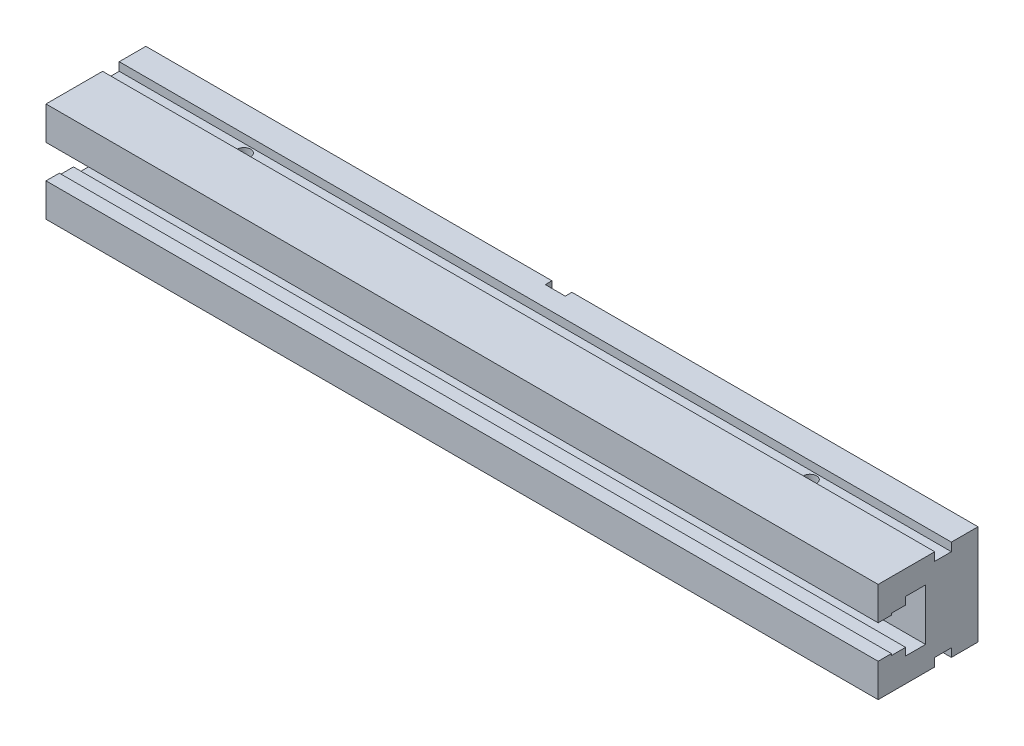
ISO-10303-21;
HEADER;
FILE_DESCRIPTION(('STEP AP214'),'2;1');
FILE_NAME('part.step','',(''),(''),'','','');
FILE_SCHEMA(('AUTOMOTIVE_DESIGN { 1 0 10303 214 1 1 1 1 }'));
ENDSEC;
DATA;
#1=APPLICATION_CONTEXT('core data for automotive mechanical design processes');
#2=APPLICATION_PROTOCOL_DEFINITION('international standard','automotive_design',2000,#1);
#3=PRODUCT_CONTEXT('',#1,'mechanical');
#4=PRODUCT('Part','Part','',(#3));
#5=PRODUCT_RELATED_PRODUCT_CATEGORY('part','',(#4));
#6=PRODUCT_DEFINITION_FORMATION('','',#4);
#7=PRODUCT_DEFINITION_CONTEXT('part definition',#1,'design');
#8=PRODUCT_DEFINITION('design','',#6,#7);
#9=PRODUCT_DEFINITION_SHAPE('','',#8);
#10=(LENGTH_UNIT() NAMED_UNIT(*) SI_UNIT(.MILLI.,.METRE.));
#11=(NAMED_UNIT(*) PLANE_ANGLE_UNIT() SI_UNIT($,.RADIAN.));
#12=(NAMED_UNIT(*) SI_UNIT($,.STERADIAN.) SOLID_ANGLE_UNIT());
#13=UNCERTAINTY_MEASURE_WITH_UNIT(LENGTH_MEASURE(1.E-05),#10,'distance_accuracy_value','');
#14=(GEOMETRIC_REPRESENTATION_CONTEXT(3) GLOBAL_UNCERTAINTY_ASSIGNED_CONTEXT((#13)) GLOBAL_UNIT_ASSIGNED_CONTEXT((#10,
#11,#12)) REPRESENTATION_CONTEXT('',''));
#15=CARTESIAN_POINT('',(0.,0.,0.));
#16=DIRECTION('',(0.,0.,1.));
#17=DIRECTION('',(1.,0.,0.));
#18=AXIS2_PLACEMENT_3D('',#15,#16,#17);
#19=CARTESIAN_POINT('',(6.,-30.0000595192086,4.));
#20=DIRECTION('',(1.,0.,0.));
#21=DIRECTION('',(0.,1.,0.));
#22=AXIS2_PLACEMENT_3D('',#19,#20,#21);
#23=PLANE('',#22);
#24=DIRECTION('',(0.,1.,0.));
#25=VECTOR('',#24,1.);
#26=CARTESIAN_POINT('',(6.,30.0000595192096,0.));
#27=LINE('',#26,#25);
#28=CARTESIAN_POINT('',(6.,-30.,0.));
#29=VERTEX_POINT('',#28);
#30=CARTESIAN_POINT('',(6.,-2.5,0.));
#31=VERTEX_POINT('',#30);
#32=EDGE_CURVE('E422',#29,#31,#27,.T.);
#33=ORIENTED_EDGE('',*,*,#32,.F.);
#34=DIRECTION('',(0.,0.,1.));
#35=VECTOR('',#34,1.);
#36=CARTESIAN_POINT('',(6.,-30.,4.));
#37=LINE('',#36,#35);
#38=CARTESIAN_POINT('',(6.,-30.,4.));
#39=VERTEX_POINT('',#38);
#40=EDGE_CURVE('E521',#29,#39,#37,.T.);
#41=ORIENTED_EDGE('',*,*,#40,.T.);
#42=DIRECTION('',(0.,1.,0.));
#43=VECTOR('',#42,1.);
#44=CARTESIAN_POINT('',(6.,-30.0000595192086,4.));
#45=LINE('',#44,#43);
#46=CARTESIAN_POINT('',(6.,-2.5,4.));
#47=VERTEX_POINT('',#46);
#48=EDGE_CURVE('E417',#39,#47,#45,.T.);
#49=ORIENTED_EDGE('',*,*,#48,.T.);
#50=DIRECTION('',(0.,0.,1.));
#51=VECTOR('',#50,1.);
#52=CARTESIAN_POINT('',(6.,-2.5,31.4999434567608));
#53=LINE('',#52,#51);
#54=EDGE_CURVE('E658',#47,#31,#53,.F.);
#55=ORIENTED_EDGE('',*,*,#54,.T.);
#56=EDGE_LOOP('',(#33,#41,#49,#55));
#57=FACE_BOUND('',#56,.T.);
#58=ADVANCED_FACE('F14',(#57),#23,.F.);
#59=CARTESIAN_POINT('',(-6.,-30.0000595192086,4.));
#60=DIRECTION('',(-1.,0.,0.));
#61=DIRECTION('',(0.,0.,1.));
#62=AXIS2_PLACEMENT_3D('',#59,#60,#61);
#63=PLANE('',#62);
#64=DIRECTION('',(0.,-1.,0.));
#65=VECTOR('',#64,1.);
#66=CARTESIAN_POINT('',(-6.,30.0000595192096,0.));
#67=LINE('',#66,#65);
#68=CARTESIAN_POINT('',(-6.,30.,0.));
#69=VERTEX_POINT('',#68);
#70=CARTESIAN_POINT('',(-6.,2.5,0.));
#71=VERTEX_POINT('',#70);
#72=EDGE_CURVE('E418',#69,#71,#67,.T.);
#73=ORIENTED_EDGE('',*,*,#72,.F.);
#74=DIRECTION('',(0.,0.,1.));
#75=VECTOR('',#74,1.);
#76=CARTESIAN_POINT('',(-6.,30.,4.));
#77=LINE('',#76,#75);
#78=CARTESIAN_POINT('',(-6.,30.,4.));
#79=VERTEX_POINT('',#78);
#80=EDGE_CURVE('E410',#69,#79,#77,.T.);
#81=ORIENTED_EDGE('',*,*,#80,.T.);
#82=DIRECTION('',(0.,1.,0.));
#83=VECTOR('',#82,1.);
#84=CARTESIAN_POINT('',(-6.,-30.0000595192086,4.));
#85=LINE('',#84,#83);
#86=CARTESIAN_POINT('',(-6.,2.49999999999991,4.));
#87=VERTEX_POINT('',#86);
#88=EDGE_CURVE('E398',#87,#79,#85,.T.);
#89=ORIENTED_EDGE('',*,*,#88,.F.);
#90=DIRECTION('',(0.,0.,1.));
#91=VECTOR('',#90,1.);
#92=CARTESIAN_POINT('',(-6.,2.49999999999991,31.4999434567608));
#93=LINE('',#92,#91);
#94=EDGE_CURVE('E408',#87,#71,#93,.F.);
#95=ORIENTED_EDGE('',*,*,#94,.T.);
#96=EDGE_LOOP('',(#73,#81,#89,#95));
#97=FACE_BOUND('',#96,.T.);
#98=ADVANCED_FACE('F407',(#97),#63,.F.);
#99=CARTESIAN_POINT('',(6.,-30.0000595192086,4.));
#100=DIRECTION('',(0.,0.,1.));
#101=DIRECTION('',(1.,0.,0.));
#102=AXIS2_PLACEMENT_3D('',#99,#100,#101);
#103=PLANE('',#102);
#104=CARTESIAN_POINT('',(0.,17.5,4.));
#105=DIRECTION('',(0.,0.,-1.));
#106=DIRECTION('',(-1.,0.,0.));
#107=AXIS2_PLACEMENT_3D('',#104,#105,#106);
#108=CIRCLE('',#107,2.5);
#109=CARTESIAN_POINT('',(-2.5,17.5,4.));
#110=VERTEX_POINT('',#109);
#111=EDGE_CURVE('E604',#110,#110,#108,.T.);
#112=ORIENTED_EDGE('',*,*,#111,.F.);
#113=EDGE_LOOP('',(#112));
#114=FACE_BOUND('',#113,.T.);
#115=ORIENTED_EDGE('',*,*,#88,.T.);
#116=DIRECTION('',(1.,0.,0.));
#117=VECTOR('',#116,1.);
#118=CARTESIAN_POINT('',(6.,30.,4.));
#119=LINE('',#118,#117);
#120=CARTESIAN_POINT('',(6.,30.,4.));
#121=VERTEX_POINT('',#120);
#122=EDGE_CURVE('E528',#79,#121,#119,.T.);
#123=ORIENTED_EDGE('',*,*,#122,.T.);
#124=CARTESIAN_POINT('',(6.,2.5,4.));
#125=VERTEX_POINT('',#124);
#126=EDGE_CURVE('E400',#125,#121,#45,.T.);
#127=ORIENTED_EDGE('',*,*,#126,.F.);
#128=CARTESIAN_POINT('',(0.,0.,4.));
#129=DIRECTION('',(0.,0.,1.));
#130=DIRECTION('',(1.,0.,0.));
#131=AXIS2_PLACEMENT_3D('',#128,#129,#130);
#132=CIRCLE('',#131,6.5);
#133=EDGE_CURVE('E369',#125,#87,#132,.T.);
#134=ORIENTED_EDGE('',*,*,#133,.T.);
#135=EDGE_LOOP('',(#115,#123,#127,#134));
#136=FACE_BOUND('',#135,.T.);
#137=ADVANCED_FACE('F396',(#114,#136),#103,.F.);
#138=CARTESIAN_POINT('',(250.,-6.00072613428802,0.));
#139=DIRECTION('',(0.,0.,1.));
#140=DIRECTION('',(1.,0.,0.));
#141=AXIS2_PLACEMENT_3D('',#138,#139,#140);
#142=PLANE('',#141);
#143=DIRECTION('',(1.,0.,0.));
#144=VECTOR('',#143,1.);
#145=CARTESIAN_POINT('',(170.,6.,0.));
#146=LINE('',#145,#144);
#147=CARTESIAN_POINT('',(170.,6.,0.));
#148=VERTEX_POINT('',#147);
#149=CARTESIAN_POINT('',(200.,6.,0.));
#150=VERTEX_POINT('',#149);
#151=EDGE_CURVE('E548',#148,#150,#146,.T.);
#152=ORIENTED_EDGE('',*,*,#151,.F.);
#153=CARTESIAN_POINT('',(170.,0.,0.));
#154=DIRECTION('',(0.,0.,-1.));
#155=DIRECTION('',(-1.,0.,0.));
#156=AXIS2_PLACEMENT_3D('',#153,#154,#155);
#157=CIRCLE('',#156,6.);
#158=CARTESIAN_POINT('',(170.,-6.,0.));
#159=VERTEX_POINT('',#158);
#160=EDGE_CURVE('E532',#159,#148,#157,.T.);
#161=ORIENTED_EDGE('',*,*,#160,.F.);
#162=DIRECTION('',(-1.,0.,0.));
#163=VECTOR('',#162,1.);
#164=CARTESIAN_POINT('',(170.,-6.,0.));
#165=LINE('',#164,#163);
#166=CARTESIAN_POINT('',(200.,-6.,0.));
#167=VERTEX_POINT('',#166);
#168=EDGE_CURVE('E537',#167,#159,#165,.T.);
#169=ORIENTED_EDGE('',*,*,#168,.F.);
#170=CARTESIAN_POINT('',(200.,0.,0.));
#171=DIRECTION('',(0.,0.,-1.));
#172=DIRECTION('',(-1.,0.,0.));
#173=AXIS2_PLACEMENT_3D('',#170,#171,#172);
#174=CIRCLE('',#173,6.);
#175=EDGE_CURVE('E551',#150,#167,#174,.T.);
#176=ORIENTED_EDGE('',*,*,#175,.F.);
#177=EDGE_LOOP('',(#152,#161,#169,#176));
#178=FACE_BOUND('',#177,.T.);
#179=CARTESIAN_POINT('',(150.,0.,1.65978342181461E-10));
#180=DIRECTION('',(0.,0.,1.));
#181=DIRECTION('',(1.,0.,0.));
#182=AXIS2_PLACEMENT_3D('',#179,#180,#181);
#183=CIRCLE('',#182,6.5);
#184=CARTESIAN_POINT('',(156.5,0.,1.65978342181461E-10));
#185=VERTEX_POINT('',#184);
#186=EDGE_CURVE('E634',#185,#185,#183,.T.);
#187=ORIENTED_EDGE('',*,*,#186,.T.);
#188=EDGE_LOOP('',(#187));
#189=FACE_BOUND('',#188,.T.);
#190=CARTESIAN_POINT('',(6.,2.5,0.));
#191=VERTEX_POINT('',#190);
#192=CARTESIAN_POINT('',(6.,30.,0.));
#193=VERTEX_POINT('',#192);
#194=EDGE_CURVE('E420',#191,#193,#27,.T.);
#195=ORIENTED_EDGE('',*,*,#194,.T.);
#196=DIRECTION('',(1.,0.,0.));
#197=VECTOR('',#196,1.);
#198=CARTESIAN_POINT('',(250.,30.,0.));
#199=LINE('',#198,#197);
#200=CARTESIAN_POINT('',(250.,30.,0.));
#201=VERTEX_POINT('',#200);
#202=EDGE_CURVE('E29',#193,#201,#199,.T.);
#203=ORIENTED_EDGE('',*,*,#202,.T.);
#204=DIRECTION('',(0.,1.,0.));
#205=VECTOR('',#204,1.);
#206=CARTESIAN_POINT('',(250.,30.0000595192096,0.));
#207=LINE('',#206,#205);
#208=CARTESIAN_POINT('',(250.,-30.,0.));
#209=VERTEX_POINT('',#208);
#210=EDGE_CURVE('E289',#209,#201,#207,.T.);
#211=ORIENTED_EDGE('',*,*,#210,.F.);
#212=DIRECTION('',(-1.,0.,0.));
#213=VECTOR('',#212,1.);
#214=CARTESIAN_POINT('',(250.,-30.,0.));
#215=LINE('',#214,#213);
#216=EDGE_CURVE('E524',#209,#29,#215,.T.);
#217=ORIENTED_EDGE('',*,*,#216,.T.);
#218=ORIENTED_EDGE('',*,*,#32,.T.);
#219=CARTESIAN_POINT('',(0.,0.,0.));
#220=DIRECTION('',(0.,0.,-1.));
#221=DIRECTION('',(-1.,0.,0.));
#222=AXIS2_PLACEMENT_3D('',#219,#220,#221);
#223=CIRCLE('',#222,6.5);
#224=EDGE_CURVE('E600',#191,#31,#223,.T.);
#225=ORIENTED_EDGE('',*,*,#224,.F.);
#226=EDGE_LOOP('',(#195,#203,#211,#217,#218,#225));
#227=FACE_BOUND('',#226,.T.);
#228=ADVANCED_FACE('F672',(#178,#189,#227),#142,.F.);
#229=CARTESIAN_POINT('',(250.,22.9994107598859,15.9999523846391));
#230=DIRECTION('',(0.,0.,-1.));
#231=DIRECTION('',(-1.,0.,0.));
#232=AXIS2_PLACEMENT_3D('',#229,#230,#231);
#233=PLANE('',#232);
#234=DIRECTION('',(0.,-1.,0.));
#235=VECTOR('',#234,1.);
#236=CARTESIAN_POINT('',(250.,22.9994107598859,15.9999523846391));
#237=LINE('',#236,#235);
#238=CARTESIAN_POINT('',(250.,30.,15.9999523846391));
#239=VERTEX_POINT('',#238);
#240=CARTESIAN_POINT('',(250.,25.,15.9999523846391));
#241=VERTEX_POINT('',#240);
#242=EDGE_CURVE('E285',#239,#241,#237,.T.);
#243=ORIENTED_EDGE('',*,*,#242,.F.);
#244=DIRECTION('',(-1.,0.,0.));
#245=VECTOR('',#244,1.);
#246=CARTESIAN_POINT('',(250.,30.,15.9999523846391));
#247=LINE('',#246,#245);
#248=CARTESIAN_POINT('',(-250.,30.,15.9999523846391));
#249=VERTEX_POINT('',#248);
#250=EDGE_CURVE('E268',#239,#249,#247,.T.);
#251=ORIENTED_EDGE('',*,*,#250,.T.);
#252=DIRECTION('',(0.,-1.,0.));
#253=VECTOR('',#252,1.);
#254=CARTESIAN_POINT('',(-250.,22.9994107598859,15.9999523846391));
#255=LINE('',#254,#253);
#256=CARTESIAN_POINT('',(-250.,25.,15.9999523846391));
#257=VERTEX_POINT('',#256);
#258=EDGE_CURVE('E424',#249,#257,#255,.T.);
#259=ORIENTED_EDGE('',*,*,#258,.T.);
#260=DIRECTION('',(-1.,0.,0.));
#261=VECTOR('',#260,1.);
#262=CARTESIAN_POINT('',(250.,25.,15.9999523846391));
#263=LINE('',#262,#261);
#264=EDGE_CURVE('E277',#241,#257,#263,.T.);
#265=ORIENTED_EDGE('',*,*,#264,.F.);
#266=EDGE_LOOP('',(#243,#251,#259,#265));
#267=FACE_BOUND('',#266,.T.);
#268=ADVANCED_FACE('F16',(#267),#233,.F.);
#269=CARTESIAN_POINT('',(250.,9.99922625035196,60.0001190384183));
#270=DIRECTION('',(0.,0.,-1.));
#271=DIRECTION('',(-1.,0.,0.));
#272=AXIS2_PLACEMENT_3D('',#269,#270,#271);
#273=PLANE('',#272);
#274=DIRECTION('',(0.,-1.,0.));
#275=VECTOR('',#274,1.);
#276=CARTESIAN_POINT('',(250.,9.99922625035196,60.0001190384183));
#277=LINE('',#276,#275);
#278=CARTESIAN_POINT('',(250.,30.,60.0001190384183));
#279=VERTEX_POINT('',#278);
#280=CARTESIAN_POINT('',(250.,9.99922625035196,60.0001190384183));
#281=VERTEX_POINT('',#280);
#282=EDGE_CURVE('E295',#279,#281,#277,.T.);
#283=ORIENTED_EDGE('',*,*,#282,.F.);
#284=DIRECTION('',(-1.,0.,0.));
#285=VECTOR('',#284,1.);
#286=CARTESIAN_POINT('',(250.,30.,60.0001190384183));
#287=LINE('',#286,#285);
#288=CARTESIAN_POINT('',(-250.,30.,60.0001190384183));
#289=VERTEX_POINT('',#288);
#290=EDGE_CURVE('E513',#279,#289,#287,.T.);
#291=ORIENTED_EDGE('',*,*,#290,.T.);
#292=DIRECTION('',(0.,-1.,0.));
#293=VECTOR('',#292,1.);
#294=CARTESIAN_POINT('',(-250.,9.99922625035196,60.0001190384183));
#295=LINE('',#294,#293);
#296=CARTESIAN_POINT('',(-250.,9.99922625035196,60.0001190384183));
#297=VERTEX_POINT('',#296);
#298=EDGE_CURVE('E426',#289,#297,#295,.T.);
#299=ORIENTED_EDGE('',*,*,#298,.T.);
#300=DIRECTION('',(-1.,0.,0.));
#301=VECTOR('',#300,1.);
#302=CARTESIAN_POINT('',(250.,9.99922625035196,60.0001190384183));
#303=LINE('',#302,#301);
#304=EDGE_CURVE('E363',#281,#297,#303,.T.);
#305=ORIENTED_EDGE('',*,*,#304,.F.);
#306=EDGE_LOOP('',(#283,#291,#299,#305));
#307=FACE_BOUND('',#306,.T.);
#308=ADVANCED_FACE('F767',(#307),#273,.F.);
#309=CARTESIAN_POINT('',(250.,9.99922625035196,60.0001190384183));
#310=DIRECTION('',(0.,1.,0.));
#311=DIRECTION('',(-1.,0.,0.));
#312=AXIS2_PLACEMENT_3D('',#309,#310,#311);
#313=PLANE('',#312);
#314=DIRECTION('',(0.,0.,-1.));
#315=VECTOR('',#314,1.);
#316=CARTESIAN_POINT('',(-250.,9.99922625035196,60.0001190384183));
#317=LINE('',#316,#315);
#318=CARTESIAN_POINT('',(-250.,9.99922625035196,52.0007380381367));
#319=VERTEX_POINT('',#318);
#320=EDGE_CURVE('E428',#297,#319,#317,.T.);
#321=ORIENTED_EDGE('',*,*,#320,.T.);
#322=DIRECTION('',(-1.,0.,0.));
#323=VECTOR('',#322,1.);
#324=CARTESIAN_POINT('',(250.,9.99922625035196,52.0007380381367));
#325=LINE('',#324,#323);
#326=CARTESIAN_POINT('',(250.,9.99922625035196,52.0007380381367));
#327=VERTEX_POINT('',#326);
#328=EDGE_CURVE('E360',#327,#319,#325,.T.);
#329=ORIENTED_EDGE('',*,*,#328,.F.);
#330=DIRECTION('',(0.,0.,-1.));
#331=VECTOR('',#330,1.);
#332=CARTESIAN_POINT('',(250.,9.99922625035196,60.0001190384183));
#333=LINE('',#332,#331);
#334=EDGE_CURVE('E297',#281,#327,#333,.T.);
#335=ORIENTED_EDGE('',*,*,#334,.F.);
#336=ORIENTED_EDGE('',*,*,#304,.T.);
#337=EDGE_LOOP('',(#321,#329,#335,#336));
#338=FACE_BOUND('',#337,.T.);
#339=ADVANCED_FACE('F764',(#338),#313,.F.);
#340=CARTESIAN_POINT('',(250.,9.99922625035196,52.0007380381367));
#341=DIRECTION('',(0.,0.,1.));
#342=DIRECTION('',(1.,0.,0.));
#343=AXIS2_PLACEMENT_3D('',#340,#341,#342);
#344=PLANE('',#343);
#345=DIRECTION('',(0.,1.,0.));
#346=VECTOR('',#345,1.);
#347=CARTESIAN_POINT('',(-250.,9.99922625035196,52.0007380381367));
#348=LINE('',#347,#346);
#349=CARTESIAN_POINT('',(-250.,11.0003392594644,52.0007380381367));
#350=VERTEX_POINT('',#349);
#351=EDGE_CURVE('E430',#319,#350,#348,.T.);
#352=ORIENTED_EDGE('',*,*,#351,.T.);
#353=DIRECTION('',(-1.,0.,0.));
#354=VECTOR('',#353,1.);
#355=CARTESIAN_POINT('',(250.,11.0003392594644,52.0007380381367));
#356=LINE('',#355,#354);
#357=CARTESIAN_POINT('',(250.,11.0003392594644,52.0007380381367));
#358=VERTEX_POINT('',#357);
#359=EDGE_CURVE('E357',#358,#350,#356,.T.);
#360=ORIENTED_EDGE('',*,*,#359,.F.);
#361=DIRECTION('',(0.,1.,0.));
#362=VECTOR('',#361,1.);
#363=CARTESIAN_POINT('',(250.,9.99922625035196,52.0007380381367));
#364=LINE('',#363,#362);
#365=EDGE_CURVE('E304',#327,#358,#364,.T.);
#366=ORIENTED_EDGE('',*,*,#365,.F.);
#367=ORIENTED_EDGE('',*,*,#328,.T.);
#368=EDGE_LOOP('',(#352,#360,#366,#367));
#369=FACE_BOUND('',#368,.T.);
#370=ADVANCED_FACE('F760',(#369),#344,.F.);
#371=CARTESIAN_POINT('',(250.,11.0003392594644,43.5002053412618));
#372=DIRECTION('',(0.,1.,0.));
#373=DIRECTION('',(-1.,0.,0.));
#374=AXIS2_PLACEMENT_3D('',#371,#372,#373);
#375=PLANE('',#374);
#376=DIRECTION('',(0.,0.,-1.));
#377=VECTOR('',#376,1.);
#378=CARTESIAN_POINT('',(-250.,11.0003392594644,43.5002053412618));
#379=LINE('',#378,#377);
#380=CARTESIAN_POINT('',(-250.,11.0003392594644,43.5002053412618));
#381=VERTEX_POINT('',#380);
#382=EDGE_CURVE('E432',#350,#381,#379,.T.);
#383=ORIENTED_EDGE('',*,*,#382,.T.);
#384=DIRECTION('',(-1.,0.,0.));
#385=VECTOR('',#384,1.);
#386=CARTESIAN_POINT('',(250.,11.0003392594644,43.5002053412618));
#387=LINE('',#386,#385);
#388=CARTESIAN_POINT('',(250.,11.0003392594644,43.5002053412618));
#389=VERTEX_POINT('',#388);
#390=EDGE_CURVE('E354',#389,#381,#387,.T.);
#391=ORIENTED_EDGE('',*,*,#390,.F.);
#392=DIRECTION('',(0.,0.,-1.));
#393=VECTOR('',#392,1.);
#394=CARTESIAN_POINT('',(250.,11.0003392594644,43.5002053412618));
#395=LINE('',#394,#393);
#396=EDGE_CURVE('E306',#358,#389,#395,.T.);
#397=ORIENTED_EDGE('',*,*,#396,.F.);
#398=ORIENTED_EDGE('',*,*,#359,.T.);
#399=EDGE_LOOP('',(#383,#391,#397,#398));
#400=FACE_BOUND('',#399,.T.);
#401=ADVANCED_FACE('F756',(#400),#375,.F.);
#402=CARTESIAN_POINT('',(250.,11.0003392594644,43.5002053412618));
#403=DIRECTION('',(0.,0.,1.));
#404=DIRECTION('',(1.,0.,0.));
#405=AXIS2_PLACEMENT_3D('',#402,#403,#404);
#406=PLANE('',#405);
#407=DIRECTION('',(0.,1.,0.));
#408=VECTOR('',#407,1.);
#409=CARTESIAN_POINT('',(-250.,11.0003392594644,43.5002053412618));
#410=LINE('',#409,#408);
#411=CARTESIAN_POINT('',(-250.,15.4999910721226,43.5002053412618));
#412=VERTEX_POINT('',#411);
#413=EDGE_CURVE('E434',#381,#412,#410,.T.);
#414=ORIENTED_EDGE('',*,*,#413,.T.);
#415=DIRECTION('',(-1.,0.,0.));
#416=VECTOR('',#415,1.);
#417=CARTESIAN_POINT('',(250.,15.4999910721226,43.5002053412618));
#418=LINE('',#417,#416);
#419=CARTESIAN_POINT('',(250.,15.4999910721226,43.5002053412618));
#420=VERTEX_POINT('',#419);
#421=EDGE_CURVE('E351',#420,#412,#418,.T.);
#422=ORIENTED_EDGE('',*,*,#421,.F.);
#423=DIRECTION('',(0.,1.,0.));
#424=VECTOR('',#423,1.);
#425=CARTESIAN_POINT('',(250.,11.0003392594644,43.5002053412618));
#426=LINE('',#425,#424);
#427=EDGE_CURVE('E308',#389,#420,#426,.T.);
#428=ORIENTED_EDGE('',*,*,#427,.F.);
#429=ORIENTED_EDGE('',*,*,#390,.T.);
#430=EDGE_LOOP('',(#414,#422,#428,#429));
#431=FACE_BOUND('',#430,.T.);
#432=ADVANCED_FACE('F752',(#431),#406,.F.);
#433=CARTESIAN_POINT('',(250.,15.4999910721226,43.5002053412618));
#434=DIRECTION('',(0.,1.,0.));
#435=DIRECTION('',(-1.,0.,0.));
#436=AXIS2_PLACEMENT_3D('',#433,#434,#435);
#437=PLANE('',#436);
#438=DIRECTION('',(0.,0.,-1.));
#439=VECTOR('',#438,1.);
#440=CARTESIAN_POINT('',(-250.,15.4999910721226,43.5002053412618));
#441=LINE('',#440,#439);
#442=CARTESIAN_POINT('',(-250.,15.4999910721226,31.4999434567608));
#443=VERTEX_POINT('',#442);
#444=EDGE_CURVE('E436',#412,#443,#441,.T.);
#445=ORIENTED_EDGE('',*,*,#444,.T.);
#446=DIRECTION('',(-1.,0.,0.));
#447=VECTOR('',#446,1.);
#448=CARTESIAN_POINT('',(250.,15.4999910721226,31.4999434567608));
#449=LINE('',#448,#447);
#450=CARTESIAN_POINT('',(250.,15.4999910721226,31.4999434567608));
#451=VERTEX_POINT('',#450);
#452=EDGE_CURVE('E348',#451,#443,#449,.T.);
#453=ORIENTED_EDGE('',*,*,#452,.F.);
#454=DIRECTION('',(0.,0.,-1.));
#455=VECTOR('',#454,1.);
#456=CARTESIAN_POINT('',(250.,15.4999910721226,43.5002053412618));
#457=LINE('',#456,#455);
#458=EDGE_CURVE('E310',#420,#451,#457,.T.);
#459=ORIENTED_EDGE('',*,*,#458,.F.);
#460=ORIENTED_EDGE('',*,*,#421,.T.);
#461=EDGE_LOOP('',(#445,#453,#459,#460));
#462=FACE_BOUND('',#461,.T.);
#463=ADVANCED_FACE('F748',(#462),#437,.F.);
#464=CARTESIAN_POINT('',(250.,15.4999910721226,31.4999434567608));
#465=DIRECTION('',(0.,0.,-1.));
#466=DIRECTION('',(-1.,0.,0.));
#467=AXIS2_PLACEMENT_3D('',#464,#465,#466);
#468=PLANE('',#467);
#469=CARTESIAN_POINT('',(-150.,0.,31.4999434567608));
#470=DIRECTION('',(0.,0.,1.));
#471=DIRECTION('',(1.,0.,0.));
#472=AXIS2_PLACEMENT_3D('',#469,#470,#471);
#473=CIRCLE('',#472,9.5);
#474=CARTESIAN_POINT('',(-140.5,0.,31.4999434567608));
#475=VERTEX_POINT('',#474);
#476=EDGE_CURVE('E631',#475,#475,#473,.T.);
#477=ORIENTED_EDGE('',*,*,#476,.F.);
#478=EDGE_LOOP('',(#477));
#479=FACE_BOUND('',#478,.T.);
#480=CARTESIAN_POINT('',(150.,0.,31.4999434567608));
#481=DIRECTION('',(0.,0.,1.));
#482=DIRECTION('',(1.,0.,0.));
#483=AXIS2_PLACEMENT_3D('',#480,#481,#482);
#484=CIRCLE('',#483,9.5);
#485=CARTESIAN_POINT('',(159.5,0.,31.4999434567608));
#486=VERTEX_POINT('',#485);
#487=EDGE_CURVE('E643',#486,#486,#484,.T.);
#488=ORIENTED_EDGE('',*,*,#487,.F.);
#489=EDGE_LOOP('',(#488));
#490=FACE_BOUND('',#489,.T.);
#491=CARTESIAN_POINT('',(0.,0.,31.4999434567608));
#492=DIRECTION('',(0.,0.,1.));
#493=DIRECTION('',(1.,0.,0.));
#494=AXIS2_PLACEMENT_3D('',#491,#492,#493);
#495=CIRCLE('',#494,9.5);
#496=CARTESIAN_POINT('',(9.5,0.,31.4999434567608));
#497=VERTEX_POINT('',#496);
#498=EDGE_CURVE('E652',#497,#497,#495,.T.);
#499=ORIENTED_EDGE('',*,*,#498,.F.);
#500=EDGE_LOOP('',(#499));
#501=FACE_BOUND('',#500,.T.);
#502=DIRECTION('',(0.,-1.,0.));
#503=VECTOR('',#502,1.);
#504=CARTESIAN_POINT('',(-250.,15.4999910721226,31.4999434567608));
#505=LINE('',#504,#503);
#506=CARTESIAN_POINT('',(-250.,-15.4999910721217,31.4999434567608));
#507=VERTEX_POINT('',#506);
#508=EDGE_CURVE('E438',#443,#507,#505,.T.);
#509=ORIENTED_EDGE('',*,*,#508,.T.);
#510=DIRECTION('',(-1.,0.,0.));
#511=VECTOR('',#510,1.);
#512=CARTESIAN_POINT('',(250.,-15.4999910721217,31.4999434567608));
#513=LINE('',#512,#511);
#514=CARTESIAN_POINT('',(250.,-15.4999910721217,31.4999434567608));
#515=VERTEX_POINT('',#514);
#516=EDGE_CURVE('E345',#515,#507,#513,.T.);
#517=ORIENTED_EDGE('',*,*,#516,.F.);
#518=DIRECTION('',(0.,-1.,0.));
#519=VECTOR('',#518,1.);
#520=CARTESIAN_POINT('',(250.,15.4999910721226,31.4999434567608));
#521=LINE('',#520,#519);
#522=EDGE_CURVE('E312',#451,#515,#521,.T.);
#523=ORIENTED_EDGE('',*,*,#522,.F.);
#524=ORIENTED_EDGE('',*,*,#452,.T.);
#525=EDGE_LOOP('',(#509,#517,#523,#524));
#526=FACE_BOUND('',#525,.T.);
#527=ADVANCED_FACE('F744',(#479,#490,#501,#526),#468,.F.);
#528=CARTESIAN_POINT('',(250.,-15.4999910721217,31.4999434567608));
#529=DIRECTION('',(0.,-1.,0.));
#530=DIRECTION('',(1.,0.,0.));
#531=AXIS2_PLACEMENT_3D('',#528,#529,#530);
#532=PLANE('',#531);
#533=DIRECTION('',(0.,0.,1.));
#534=VECTOR('',#533,1.);
#535=CARTESIAN_POINT('',(-250.,-15.4999910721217,31.4999434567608));
#536=LINE('',#535,#534);
#537=CARTESIAN_POINT('',(-250.,-15.4999910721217,43.5002053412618));
#538=VERTEX_POINT('',#537);
#539=EDGE_CURVE('E440',#507,#538,#536,.T.);
#540=ORIENTED_EDGE('',*,*,#539,.T.);
#541=DIRECTION('',(-1.,0.,0.));
#542=VECTOR('',#541,1.);
#543=CARTESIAN_POINT('',(250.,-15.4999910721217,43.5002053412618));
#544=LINE('',#543,#542);
#545=CARTESIAN_POINT('',(250.,-15.4999910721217,43.5002053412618));
#546=VERTEX_POINT('',#545);
#547=EDGE_CURVE('E342',#546,#538,#544,.T.);
#548=ORIENTED_EDGE('',*,*,#547,.F.);
#549=DIRECTION('',(0.,0.,1.));
#550=VECTOR('',#549,1.);
#551=CARTESIAN_POINT('',(250.,-15.4999910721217,31.4999434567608));
#552=LINE('',#551,#550);
#553=EDGE_CURVE('E314',#515,#546,#552,.T.);
#554=ORIENTED_EDGE('',*,*,#553,.F.);
#555=ORIENTED_EDGE('',*,*,#516,.T.);
#556=EDGE_LOOP('',(#540,#548,#554,#555));
#557=FACE_BOUND('',#556,.T.);
#558=ADVANCED_FACE('F740',(#557),#532,.F.);
#559=CARTESIAN_POINT('',(250.,-15.4999910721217,43.5002053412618));
#560=DIRECTION('',(0.,0.,1.));
#561=DIRECTION('',(1.,0.,0.));
#562=AXIS2_PLACEMENT_3D('',#559,#560,#561);
#563=PLANE('',#562);
#564=DIRECTION('',(0.,1.,0.));
#565=VECTOR('',#564,1.);
#566=CARTESIAN_POINT('',(-250.,-15.4999910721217,43.5002053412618));
#567=LINE('',#566,#565);
#568=CARTESIAN_POINT('',(-250.,-11.0003392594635,43.5002053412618));
#569=VERTEX_POINT('',#568);
#570=EDGE_CURVE('E442',#538,#569,#567,.T.);
#571=ORIENTED_EDGE('',*,*,#570,.T.);
#572=DIRECTION('',(-1.,0.,0.));
#573=VECTOR('',#572,1.);
#574=CARTESIAN_POINT('',(250.,-11.0003392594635,43.5002053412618));
#575=LINE('',#574,#573);
#576=CARTESIAN_POINT('',(250.,-11.0003392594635,43.5002053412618));
#577=VERTEX_POINT('',#576);
#578=EDGE_CURVE('E339',#577,#569,#575,.T.);
#579=ORIENTED_EDGE('',*,*,#578,.F.);
#580=DIRECTION('',(0.,1.,0.));
#581=VECTOR('',#580,1.);
#582=CARTESIAN_POINT('',(250.,-15.4999910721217,43.5002053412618));
#583=LINE('',#582,#581);
#584=EDGE_CURVE('E316',#546,#577,#583,.T.);
#585=ORIENTED_EDGE('',*,*,#584,.F.);
#586=ORIENTED_EDGE('',*,*,#547,.T.);
#587=EDGE_LOOP('',(#571,#579,#585,#586));
#588=FACE_BOUND('',#587,.T.);
#589=ADVANCED_FACE('F736',(#588),#563,.F.);
#590=CARTESIAN_POINT('',(250.,-11.0003392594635,43.5002053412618));
#591=DIRECTION('',(0.,-1.,0.));
#592=DIRECTION('',(1.,0.,0.));
#593=AXIS2_PLACEMENT_3D('',#590,#591,#592);
#594=PLANE('',#593);
#595=DIRECTION('',(0.,0.,1.));
#596=VECTOR('',#595,1.);
#597=CARTESIAN_POINT('',(-250.,-11.0003392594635,43.5002053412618));
#598=LINE('',#597,#596);
#599=CARTESIAN_POINT('',(-250.,-11.0003392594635,52.0007380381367));
#600=VERTEX_POINT('',#599);
#601=EDGE_CURVE('E444',#569,#600,#598,.T.);
#602=ORIENTED_EDGE('',*,*,#601,.T.);
#603=DIRECTION('',(-1.,0.,0.));
#604=VECTOR('',#603,1.);
#605=CARTESIAN_POINT('',(250.,-11.0003392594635,52.0007380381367));
#606=LINE('',#605,#604);
#607=CARTESIAN_POINT('',(250.,-11.0003392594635,52.0007380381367));
#608=VERTEX_POINT('',#607);
#609=EDGE_CURVE('E336',#608,#600,#606,.T.);
#610=ORIENTED_EDGE('',*,*,#609,.F.);
#611=DIRECTION('',(0.,0.,1.));
#612=VECTOR('',#611,1.);
#613=CARTESIAN_POINT('',(250.,-11.0003392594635,43.5002053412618));
#614=LINE('',#613,#612);
#615=EDGE_CURVE('E318',#577,#608,#614,.T.);
#616=ORIENTED_EDGE('',*,*,#615,.F.);
#617=ORIENTED_EDGE('',*,*,#578,.T.);
#618=EDGE_LOOP('',(#602,#610,#616,#617));
#619=FACE_BOUND('',#618,.T.);
#620=ADVANCED_FACE('F732',(#619),#594,.F.);
#621=CARTESIAN_POINT('',(250.,-10.0004166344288,52.0007380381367));
#622=DIRECTION('',(0.,0.,1.));
#623=DIRECTION('',(1.,0.,0.));
#624=AXIS2_PLACEMENT_3D('',#621,#622,#623);
#625=PLANE('',#624);
#626=DIRECTION('',(0.,1.,0.));
#627=VECTOR('',#626,1.);
#628=CARTESIAN_POINT('',(-250.,-10.0004166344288,52.0007380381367));
#629=LINE('',#628,#627);
#630=CARTESIAN_POINT('',(-250.,-10.0004166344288,52.0007380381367));
#631=VERTEX_POINT('',#630);
#632=EDGE_CURVE('E446',#600,#631,#629,.T.);
#633=ORIENTED_EDGE('',*,*,#632,.T.);
#634=DIRECTION('',(-1.,0.,0.));
#635=VECTOR('',#634,1.);
#636=CARTESIAN_POINT('',(250.,-10.0004166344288,52.0007380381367));
#637=LINE('',#636,#635);
#638=CARTESIAN_POINT('',(250.,-10.0004166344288,52.0007380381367));
#639=VERTEX_POINT('',#638);
#640=EDGE_CURVE('E333',#639,#631,#637,.T.);
#641=ORIENTED_EDGE('',*,*,#640,.F.);
#642=DIRECTION('',(0.,1.,0.));
#643=VECTOR('',#642,1.);
#644=CARTESIAN_POINT('',(250.,-10.0004166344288,52.0007380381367));
#645=LINE('',#644,#643);
#646=EDGE_CURVE('E320',#608,#639,#645,.T.);
#647=ORIENTED_EDGE('',*,*,#646,.F.);
#648=ORIENTED_EDGE('',*,*,#609,.T.);
#649=EDGE_LOOP('',(#633,#641,#647,#648));
#650=FACE_BOUND('',#649,.T.);
#651=ADVANCED_FACE('F728',(#650),#625,.F.);
#652=CARTESIAN_POINT('',(250.,-10.0004166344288,52.0007380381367));
#653=DIRECTION('',(0.,-1.,0.));
#654=DIRECTION('',(1.,0.,0.));
#655=AXIS2_PLACEMENT_3D('',#652,#653,#654);
#656=PLANE('',#655);
#657=DIRECTION('',(0.,0.,1.));
#658=VECTOR('',#657,1.);
#659=CARTESIAN_POINT('',(-250.,-10.0004166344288,52.0007380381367));
#660=LINE('',#659,#658);
#661=CARTESIAN_POINT('',(-250.,-10.0004166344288,60.0001190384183));
#662=VERTEX_POINT('',#661);
#663=EDGE_CURVE('E448',#631,#662,#660,.T.);
#664=ORIENTED_EDGE('',*,*,#663,.T.);
#665=DIRECTION('',(-1.,0.,0.));
#666=VECTOR('',#665,1.);
#667=CARTESIAN_POINT('',(250.,-10.0004166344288,60.0001190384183));
#668=LINE('',#667,#666);
#669=CARTESIAN_POINT('',(250.,-10.0004166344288,60.0001190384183));
#670=VERTEX_POINT('',#669);
#671=EDGE_CURVE('E330',#670,#662,#668,.T.);
#672=ORIENTED_EDGE('',*,*,#671,.F.);
#673=DIRECTION('',(0.,0.,1.));
#674=VECTOR('',#673,1.);
#675=CARTESIAN_POINT('',(250.,-10.0004166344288,52.0007380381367));
#676=LINE('',#675,#674);
#677=EDGE_CURVE('E322',#639,#670,#676,.T.);
#678=ORIENTED_EDGE('',*,*,#677,.F.);
#679=ORIENTED_EDGE('',*,*,#640,.T.);
#680=EDGE_LOOP('',(#664,#672,#678,#679));
#681=FACE_BOUND('',#680,.T.);
#682=ADVANCED_FACE('F724',(#681),#656,.F.);
#683=CARTESIAN_POINT('',(250.,-30.0000595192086,60.0001190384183));
#684=DIRECTION('',(0.,0.,-1.));
#685=DIRECTION('',(-1.,0.,0.));
#686=AXIS2_PLACEMENT_3D('',#683,#684,#685);
#687=PLANE('',#686);
#688=DIRECTION('',(0.,-1.,0.));
#689=VECTOR('',#688,1.);
#690=CARTESIAN_POINT('',(-250.,-30.0000595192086,60.0001190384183));
#691=LINE('',#690,#689);
#692=CARTESIAN_POINT('',(-250.,-30.,60.0001190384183));
#693=VERTEX_POINT('',#692);
#694=EDGE_CURVE('E450',#662,#693,#691,.T.);
#695=ORIENTED_EDGE('',*,*,#694,.T.);
#696=DIRECTION('',(1.,0.,0.));
#697=VECTOR('',#696,1.);
#698=CARTESIAN_POINT('',(250.,-30.,60.0001190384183));
#699=LINE('',#698,#697);
#700=CARTESIAN_POINT('',(250.,-30.,60.0001190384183));
#701=VERTEX_POINT('',#700);
#702=EDGE_CURVE('E516',#693,#701,#699,.T.);
#703=ORIENTED_EDGE('',*,*,#702,.T.);
#704=DIRECTION('',(0.,-1.,0.));
#705=VECTOR('',#704,1.);
#706=CARTESIAN_POINT('',(250.,-30.0000595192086,60.0001190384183));
#707=LINE('',#706,#705);
#708=EDGE_CURVE('E324',#670,#701,#707,.T.);
#709=ORIENTED_EDGE('',*,*,#708,.F.);
#710=ORIENTED_EDGE('',*,*,#671,.T.);
#711=EDGE_LOOP('',(#695,#703,#709,#710));
#712=FACE_BOUND('',#711,.T.);
#713=ADVANCED_FACE('F720',(#712),#687,.F.);
#714=CARTESIAN_POINT('',(250.,-23.0006011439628,15.9999523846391));
#715=DIRECTION('',(0.,0.,-1.));
#716=DIRECTION('',(-1.,0.,0.));
#717=AXIS2_PLACEMENT_3D('',#714,#715,#716);
#718=PLANE('',#717);
#719=DIRECTION('',(0.,-1.,0.));
#720=VECTOR('',#719,1.);
#721=CARTESIAN_POINT('',(-250.,-23.0006011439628,15.9999523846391));
#722=LINE('',#721,#720);
#723=CARTESIAN_POINT('',(-250.,-25.,15.9999523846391));
#724=VERTEX_POINT('',#723);
#725=CARTESIAN_POINT('',(-250.,-30.,15.9999523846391));
#726=VERTEX_POINT('',#725);
#727=EDGE_CURVE('E453',#724,#726,#722,.T.);
#728=ORIENTED_EDGE('',*,*,#727,.T.);
#729=DIRECTION('',(-1.,0.,0.));
#730=VECTOR('',#729,1.);
#731=CARTESIAN_POINT('',(250.,-30.,15.9999523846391));
#732=LINE('',#731,#730);
#733=CARTESIAN_POINT('',(250.,-30.,15.9999523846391));
#734=VERTEX_POINT('',#733);
#735=EDGE_CURVE('E471',#734,#726,#732,.T.);
#736=ORIENTED_EDGE('',*,*,#735,.F.);
#737=DIRECTION('',(0.,-1.,0.));
#738=VECTOR('',#737,1.);
#739=CARTESIAN_POINT('',(250.,-23.0006011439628,15.9999523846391));
#740=LINE('',#739,#738);
#741=CARTESIAN_POINT('',(250.,-25.,15.9999523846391));
#742=VERTEX_POINT('',#741);
#743=EDGE_CURVE('E327',#742,#734,#740,.T.);
#744=ORIENTED_EDGE('',*,*,#743,.F.);
#745=DIRECTION('',(-1.,0.,0.));
#746=VECTOR('',#745,1.);
#747=CARTESIAN_POINT('',(250.,-25.,15.9999523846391));
#748=LINE('',#747,#746);
#749=EDGE_CURVE('E475',#742,#724,#748,.T.);
#750=ORIENTED_EDGE('',*,*,#749,.T.);
#751=EDGE_LOOP('',(#728,#736,#744,#750));
#752=FACE_BOUND('',#751,.T.);
#753=ADVANCED_FACE('F716',(#752),#718,.F.);
#754=DIRECTION('',(1.,0.,0.));
#755=VECTOR('',#754,1.);
#756=CARTESIAN_POINT('',(-200.,6.,0.));
#757=LINE('',#756,#755);
#758=CARTESIAN_POINT('',(-200.,6.,0.));
#759=VERTEX_POINT('',#758);
#760=CARTESIAN_POINT('',(-170.,6.,0.));
#761=VERTEX_POINT('',#760);
#762=EDGE_CURVE('E578',#759,#761,#757,.T.);
#763=ORIENTED_EDGE('',*,*,#762,.F.);
#764=CARTESIAN_POINT('',(-200.,0.,0.));
#765=DIRECTION('',(0.,0.,-1.));
#766=DIRECTION('',(-1.,0.,0.));
#767=AXIS2_PLACEMENT_3D('',#764,#765,#766);
#768=CIRCLE('',#767,6.);
#769=CARTESIAN_POINT('',(-200.,-6.,0.));
#770=VERTEX_POINT('',#769);
#771=EDGE_CURVE('E378',#770,#759,#768,.T.);
#772=ORIENTED_EDGE('',*,*,#771,.F.);
#773=DIRECTION('',(-1.,0.,0.));
#774=VECTOR('',#773,1.);
#775=CARTESIAN_POINT('',(-200.,-6.,0.));
#776=LINE('',#775,#774);
#777=CARTESIAN_POINT('',(-170.,-6.,0.));
#778=VERTEX_POINT('',#777);
#779=EDGE_CURVE('E567',#778,#770,#776,.T.);
#780=ORIENTED_EDGE('',*,*,#779,.F.);
#781=CARTESIAN_POINT('',(-170.,0.,0.));
#782=DIRECTION('',(0.,0.,-1.));
#783=DIRECTION('',(-1.,0.,0.));
#784=AXIS2_PLACEMENT_3D('',#781,#782,#783);
#785=CIRCLE('',#784,6.);
#786=EDGE_CURVE('E581',#761,#778,#785,.T.);
#787=ORIENTED_EDGE('',*,*,#786,.F.);
#788=EDGE_LOOP('',(#763,#772,#780,#787));
#789=FACE_BOUND('',#788,.T.);
#790=CARTESIAN_POINT('',(-150.,0.,1.65978342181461E-10));
#791=DIRECTION('',(0.,0.,1.));
#792=DIRECTION('',(1.,0.,0.));
#793=AXIS2_PLACEMENT_3D('',#790,#791,#792);
#794=CIRCLE('',#793,6.5);
#795=CARTESIAN_POINT('',(-143.5,0.,1.65978342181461E-10));
#796=VERTEX_POINT('',#795);
#797=EDGE_CURVE('E622',#796,#796,#794,.T.);
#798=ORIENTED_EDGE('',*,*,#797,.T.);
#799=EDGE_LOOP('',(#798));
#800=FACE_BOUND('',#799,.T.);
#801=DIRECTION('',(0.,1.,0.));
#802=VECTOR('',#801,1.);
#803=CARTESIAN_POINT('',(-250.,-6.00072613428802,0.));
#804=LINE('',#803,#802);
#805=CARTESIAN_POINT('',(-250.,-30.,0.));
#806=VERTEX_POINT('',#805);
#807=CARTESIAN_POINT('',(-250.,30.,0.));
#808=VERTEX_POINT('',#807);
#809=EDGE_CURVE('E299',#806,#808,#804,.T.);
#810=ORIENTED_EDGE('',*,*,#809,.T.);
#811=DIRECTION('',(1.,0.,0.));
#812=VECTOR('',#811,1.);
#813=CARTESIAN_POINT('',(250.,30.,0.));
#814=LINE('',#813,#812);
#815=EDGE_CURVE('E461',#808,#69,#814,.T.);
#816=ORIENTED_EDGE('',*,*,#815,.T.);
#817=ORIENTED_EDGE('',*,*,#72,.T.);
#818=CARTESIAN_POINT('',(-6.,-2.5,0.));
#819=VERTEX_POINT('',#818);
#820=EDGE_CURVE('E598',#819,#71,#223,.T.);
#821=ORIENTED_EDGE('',*,*,#820,.F.);
#822=CARTESIAN_POINT('',(-6.,-30.,0.));
#823=VERTEX_POINT('',#822);
#824=EDGE_CURVE('E421',#819,#823,#67,.T.);
#825=ORIENTED_EDGE('',*,*,#824,.T.);
#826=DIRECTION('',(-1.,0.,0.));
#827=VECTOR('',#826,1.);
#828=CARTESIAN_POINT('',(250.,-30.,0.));
#829=LINE('',#828,#827);
#830=EDGE_CURVE('E463',#823,#806,#829,.T.);
#831=ORIENTED_EDGE('',*,*,#830,.T.);
#832=EDGE_LOOP('',(#810,#816,#817,#821,#825,#831));
#833=FACE_BOUND('',#832,.T.);
#834=ADVANCED_FACE('F460',(#789,#800,#833),#142,.F.);
#835=CARTESIAN_POINT('',(250.,5.99953575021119,0.));
#836=DIRECTION('',(-1.,0.,0.));
#837=DIRECTION('',(0.,-1.,0.));
#838=AXIS2_PLACEMENT_3D('',#835,#836,#837);
#839=PLANE('',#838);
#840=DIRECTION('',(0.,1.,0.));
#841=VECTOR('',#840,1.);
#842=CARTESIAN_POINT('',(250.,25.0000595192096,25.9999523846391));
#843=LINE('',#842,#841);
#844=CARTESIAN_POINT('',(250.,25.,25.9999523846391));
#845=VERTEX_POINT('',#844);
#846=CARTESIAN_POINT('',(250.,30.,25.9999523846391));
#847=VERTEX_POINT('',#846);
#848=EDGE_CURVE('E611',#845,#847,#843,.T.);
#849=ORIENTED_EDGE('',*,*,#848,.T.);
#850=DIRECTION('',(0.,0.,1.));
#851=VECTOR('',#850,1.);
#852=CARTESIAN_POINT('',(250.,30.,62.7345317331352));
#853=LINE('',#852,#851);
#854=EDGE_CURVE('E278',#847,#279,#853,.T.);
#855=ORIENTED_EDGE('',*,*,#854,.T.);
#856=ORIENTED_EDGE('',*,*,#282,.T.);
#857=ORIENTED_EDGE('',*,*,#334,.T.);
#858=ORIENTED_EDGE('',*,*,#365,.T.);
#859=ORIENTED_EDGE('',*,*,#396,.T.);
#860=ORIENTED_EDGE('',*,*,#427,.T.);
#861=ORIENTED_EDGE('',*,*,#458,.T.);
#862=ORIENTED_EDGE('',*,*,#522,.T.);
#863=ORIENTED_EDGE('',*,*,#553,.T.);
#864=ORIENTED_EDGE('',*,*,#584,.T.);
#865=ORIENTED_EDGE('',*,*,#615,.T.);
#866=ORIENTED_EDGE('',*,*,#646,.T.);
#867=ORIENTED_EDGE('',*,*,#677,.T.);
#868=ORIENTED_EDGE('',*,*,#708,.T.);
#869=DIRECTION('',(0.,0.,-1.));
#870=VECTOR('',#869,1.);
#871=CARTESIAN_POINT('',(250.,-30.,62.7345317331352));
#872=LINE('',#871,#870);
#873=CARTESIAN_POINT('',(250.,-30.,25.9999523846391));
#874=VERTEX_POINT('',#873);
#875=EDGE_CURVE('E486',#701,#874,#872,.T.);
#876=ORIENTED_EDGE('',*,*,#875,.T.);
#877=DIRECTION('',(0.,1.,0.));
#878=VECTOR('',#877,1.);
#879=CARTESIAN_POINT('',(250.,-25.0000595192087,25.9999523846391));
#880=LINE('',#879,#878);
#881=CARTESIAN_POINT('',(250.,-25.,25.9999523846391));
#882=VERTEX_POINT('',#881);
#883=EDGE_CURVE('E618',#874,#882,#880,.T.);
#884=ORIENTED_EDGE('',*,*,#883,.T.);
#885=DIRECTION('',(0.,0.,-1.));
#886=VECTOR('',#885,1.);
#887=CARTESIAN_POINT('',(250.,-25.,25.9999523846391));
#888=LINE('',#887,#886);
#889=EDGE_CURVE('E489',#882,#742,#888,.T.);
#890=ORIENTED_EDGE('',*,*,#889,.T.);
#891=ORIENTED_EDGE('',*,*,#743,.T.);
#892=DIRECTION('',(0.,0.,-1.));
#893=VECTOR('',#892,1.);
#894=CARTESIAN_POINT('',(250.,-30.,15.9999523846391));
#895=LINE('',#894,#893);
#896=EDGE_CURVE('E492',#734,#209,#895,.T.);
#897=ORIENTED_EDGE('',*,*,#896,.T.);
#898=ORIENTED_EDGE('',*,*,#210,.T.);
#899=DIRECTION('',(0.,0.,1.));
#900=VECTOR('',#899,1.);
#901=CARTESIAN_POINT('',(250.,30.,15.9999523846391));
#902=LINE('',#901,#900);
#903=EDGE_CURVE('E271',#201,#239,#902,.T.);
#904=ORIENTED_EDGE('',*,*,#903,.T.);
#905=ORIENTED_EDGE('',*,*,#242,.T.);
#906=DIRECTION('',(0.,0.,1.));
#907=VECTOR('',#906,1.);
#908=CARTESIAN_POINT('',(250.,25.,25.9999523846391));
#909=LINE('',#908,#907);
#910=EDGE_CURVE('E290',#241,#845,#909,.T.);
#911=ORIENTED_EDGE('',*,*,#910,.T.);
#912=EDGE_LOOP('',(#849,#855,#856,#857,#858,#859,#860,#861,#862,#863,#864,#865,#866,#867,#868,
#876,#884,#890,#891,#897,#898,#904,#905,#911));
#913=FACE_BOUND('',#912,.T.);
#914=ADVANCED_FACE('F283',(#913),#839,.F.);
#915=CARTESIAN_POINT('',(-250.,5.99953575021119,0.));
#916=DIRECTION('',(-1.,0.,0.));
#917=DIRECTION('',(0.,-1.,0.));
#918=AXIS2_PLACEMENT_3D('',#915,#916,#917);
#919=PLANE('',#918);
#920=DIRECTION('',(0.,0.,1.));
#921=VECTOR('',#920,1.);
#922=CARTESIAN_POINT('',(-250.,30.,62.7345317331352));
#923=LINE('',#922,#921);
#924=CARTESIAN_POINT('',(-250.,30.,25.9999523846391));
#925=VERTEX_POINT('',#924);
#926=EDGE_CURVE('E291',#925,#289,#923,.T.);
#927=ORIENTED_EDGE('',*,*,#926,.F.);
#928=DIRECTION('',(0.,1.,0.));
#929=VECTOR('',#928,1.);
#930=CARTESIAN_POINT('',(-250.,25.0000595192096,25.9999523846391));
#931=LINE('',#930,#929);
#932=CARTESIAN_POINT('',(-250.,25.,25.9999523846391));
#933=VERTEX_POINT('',#932);
#934=EDGE_CURVE('E615',#933,#925,#931,.T.);
#935=ORIENTED_EDGE('',*,*,#934,.F.);
#936=DIRECTION('',(0.,0.,1.));
#937=VECTOR('',#936,1.);
#938=CARTESIAN_POINT('',(-250.,25.,25.9999523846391));
#939=LINE('',#938,#937);
#940=EDGE_CURVE('E470',#257,#933,#939,.T.);
#941=ORIENTED_EDGE('',*,*,#940,.F.);
#942=ORIENTED_EDGE('',*,*,#258,.F.);
#943=DIRECTION('',(0.,0.,1.));
#944=VECTOR('',#943,1.);
#945=CARTESIAN_POINT('',(-250.,30.,15.9999523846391));
#946=LINE('',#945,#944);
#947=EDGE_CURVE('E273',#808,#249,#946,.T.);
#948=ORIENTED_EDGE('',*,*,#947,.F.);
#949=ORIENTED_EDGE('',*,*,#809,.F.);
#950=DIRECTION('',(0.,0.,-1.));
#951=VECTOR('',#950,1.);
#952=CARTESIAN_POINT('',(-250.,-30.,15.9999523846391));
#953=LINE('',#952,#951);
#954=EDGE_CURVE('E468',#726,#806,#953,.T.);
#955=ORIENTED_EDGE('',*,*,#954,.F.);
#956=ORIENTED_EDGE('',*,*,#727,.F.);
#957=DIRECTION('',(0.,0.,-1.));
#958=VECTOR('',#957,1.);
#959=CARTESIAN_POINT('',(-250.,-25.,25.9999523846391));
#960=LINE('',#959,#958);
#961=CARTESIAN_POINT('',(-250.,-25.,25.9999523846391));
#962=VERTEX_POINT('',#961);
#963=EDGE_CURVE('E497',#962,#724,#960,.T.);
#964=ORIENTED_EDGE('',*,*,#963,.F.);
#965=DIRECTION('',(0.,1.,0.));
#966=VECTOR('',#965,1.);
#967=CARTESIAN_POINT('',(-250.,-25.0000595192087,25.9999523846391));
#968=LINE('',#967,#966);
#969=CARTESIAN_POINT('',(-250.,-30.,25.9999523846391));
#970=VERTEX_POINT('',#969);
#971=EDGE_CURVE('E620',#970,#962,#968,.T.);
#972=ORIENTED_EDGE('',*,*,#971,.F.);
#973=DIRECTION('',(0.,0.,-1.));
#974=VECTOR('',#973,1.);
#975=CARTESIAN_POINT('',(-250.,-30.,62.7345317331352));
#976=LINE('',#975,#974);
#977=EDGE_CURVE('E495',#693,#970,#976,.T.);
#978=ORIENTED_EDGE('',*,*,#977,.F.);
#979=ORIENTED_EDGE('',*,*,#694,.F.);
#980=ORIENTED_EDGE('',*,*,#663,.F.);
#981=ORIENTED_EDGE('',*,*,#632,.F.);
#982=ORIENTED_EDGE('',*,*,#601,.F.);
#983=ORIENTED_EDGE('',*,*,#570,.F.);
#984=ORIENTED_EDGE('',*,*,#539,.F.);
#985=ORIENTED_EDGE('',*,*,#508,.F.);
#986=ORIENTED_EDGE('',*,*,#444,.F.);
#987=ORIENTED_EDGE('',*,*,#413,.F.);
#988=ORIENTED_EDGE('',*,*,#382,.F.);
#989=ORIENTED_EDGE('',*,*,#351,.F.);
#990=ORIENTED_EDGE('',*,*,#320,.F.);
#991=ORIENTED_EDGE('',*,*,#298,.F.);
#992=EDGE_LOOP('',(#927,#935,#941,#942,#948,#949,#955,#956,#964,#972,#978,#979,#980,#981,#982,
#983,#984,#985,#986,#987,#988,#989,#990,#991));
#993=FACE_BOUND('',#992,.T.);
#994=ADVANCED_FACE('F467',(#993),#919,.T.);
#995=ORIENTED_EDGE('',*,*,#126,.T.);
#996=DIRECTION('',(0.,0.,-1.));
#997=VECTOR('',#996,1.);
#998=CARTESIAN_POINT('',(6.,30.,4.));
#999=LINE('',#998,#997);
#1000=EDGE_CURVE('E9',#121,#193,#999,.T.);
#1001=ORIENTED_EDGE('',*,*,#1000,.T.);
#1002=ORIENTED_EDGE('',*,*,#194,.F.);
#1003=DIRECTION('',(0.,0.,1.));
#1004=VECTOR('',#1003,1.);
#1005=CARTESIAN_POINT('',(6.,2.5,31.4999434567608));
#1006=LINE('',#1005,#1004);
#1007=EDGE_CURVE('E412',#191,#125,#1006,.T.);
#1008=ORIENTED_EDGE('',*,*,#1007,.T.);
#1009=EDGE_LOOP('',(#995,#1001,#1002,#1008));
#1010=FACE_BOUND('',#1009,.T.);
#1011=ADVANCED_FACE('F674',(#1010),#23,.F.);
#1012=CARTESIAN_POINT('',(-6.,-30.,4.));
#1013=VERTEX_POINT('',#1012);
#1014=CARTESIAN_POINT('',(-6.,-2.5,4.));
#1015=VERTEX_POINT('',#1014);
#1016=EDGE_CURVE('E411',#1013,#1015,#85,.T.);
#1017=ORIENTED_EDGE('',*,*,#1016,.F.);
#1018=DIRECTION('',(0.,0.,-1.));
#1019=VECTOR('',#1018,1.);
#1020=CARTESIAN_POINT('',(-6.,-30.,4.));
#1021=LINE('',#1020,#1019);
#1022=EDGE_CURVE('E36',#1013,#823,#1021,.T.);
#1023=ORIENTED_EDGE('',*,*,#1022,.T.);
#1024=ORIENTED_EDGE('',*,*,#824,.F.);
#1025=DIRECTION('',(0.,0.,1.));
#1026=VECTOR('',#1025,1.);
#1027=CARTESIAN_POINT('',(-6.,-2.49999999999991,31.4999434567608));
#1028=LINE('',#1027,#1026);
#1029=EDGE_CURVE('E655',#819,#1015,#1028,.T.);
#1030=ORIENTED_EDGE('',*,*,#1029,.T.);
#1031=EDGE_LOOP('',(#1017,#1023,#1024,#1030));
#1032=FACE_BOUND('',#1031,.T.);
#1033=ADVANCED_FACE('F678',(#1032),#63,.F.);
#1034=CARTESIAN_POINT('',(0.,-17.5,4.));
#1035=DIRECTION('',(0.,0.,-1.));
#1036=DIRECTION('',(-1.,0.,0.));
#1037=AXIS2_PLACEMENT_3D('',#1034,#1035,#1036);
#1038=CIRCLE('',#1037,2.5);
#1039=CARTESIAN_POINT('',(-2.5,-17.5,4.));
#1040=VERTEX_POINT('',#1039);
#1041=EDGE_CURVE('E605',#1040,#1040,#1038,.T.);
#1042=ORIENTED_EDGE('',*,*,#1041,.F.);
#1043=EDGE_LOOP('',(#1042));
#1044=FACE_BOUND('',#1043,.T.);
#1045=ORIENTED_EDGE('',*,*,#48,.F.);
#1046=DIRECTION('',(-1.,0.,0.));
#1047=VECTOR('',#1046,1.);
#1048=CARTESIAN_POINT('',(6.,-30.,4.));
#1049=LINE('',#1048,#1047);
#1050=EDGE_CURVE('E22',#39,#1013,#1049,.T.);
#1051=ORIENTED_EDGE('',*,*,#1050,.T.);
#1052=ORIENTED_EDGE('',*,*,#1016,.T.);
#1053=EDGE_CURVE('E366',#1015,#47,#132,.T.);
#1054=ORIENTED_EDGE('',*,*,#1053,.T.);
#1055=EDGE_LOOP('',(#1045,#1051,#1052,#1054));
#1056=FACE_BOUND('',#1055,.T.);
#1057=ADVANCED_FACE('F679',(#1044,#1056),#103,.F.);
#1058=CARTESIAN_POINT('',(0.,0.,31.4999434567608));
#1059=DIRECTION('',(0.,0.,1.));
#1060=DIRECTION('',(1.,0.,0.));
#1061=AXIS2_PLACEMENT_3D('',#1058,#1059,#1060);
#1062=CYLINDRICAL_SURFACE('',#1061,6.5);
#1063=ORIENTED_EDGE('',*,*,#1007,.F.);
#1064=ORIENTED_EDGE('',*,*,#224,.T.);
#1065=ORIENTED_EDGE('',*,*,#54,.F.);
#1066=ORIENTED_EDGE('',*,*,#1053,.F.);
#1067=ORIENTED_EDGE('',*,*,#1029,.F.);
#1068=ORIENTED_EDGE('',*,*,#820,.T.);
#1069=ORIENTED_EDGE('',*,*,#94,.F.);
#1070=ORIENTED_EDGE('',*,*,#133,.F.);
#1071=EDGE_LOOP('',(#1063,#1064,#1065,#1066,#1067,#1068,#1069,#1070));
#1072=FACE_BOUND('',#1071,.T.);
#1073=CARTESIAN_POINT('',(0.,0.,18.4999434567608));
#1074=DIRECTION('',(0.,0.,1.));
#1075=DIRECTION('',(1.,0.,0.));
#1076=AXIS2_PLACEMENT_3D('',#1073,#1074,#1075);
#1077=CIRCLE('',#1076,6.5);
#1078=CARTESIAN_POINT('',(6.5,0.,18.4999434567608));
#1079=VERTEX_POINT('',#1078);
#1080=EDGE_CURVE('E646',#1079,#1079,#1077,.T.);
#1081=ORIENTED_EDGE('',*,*,#1080,.T.);
#1082=EDGE_LOOP('',(#1081));
#1083=FACE_BOUND('',#1082,.T.);
#1084=ADVANCED_FACE('F667',(#1072,#1083),#1062,.F.);
#1085=CARTESIAN_POINT('',(0.,0.,31.4999434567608));
#1086=DIRECTION('',(0.,0.,1.));
#1087=DIRECTION('',(1.,0.,0.));
#1088=AXIS2_PLACEMENT_3D('',#1085,#1086,#1087);
#1089=CYLINDRICAL_SURFACE('',#1088,9.5);
#1090=CARTESIAN_POINT('',(0.,0.,18.4999434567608));
#1091=DIRECTION('',(0.,0.,1.));
#1092=DIRECTION('',(1.,0.,0.));
#1093=AXIS2_PLACEMENT_3D('',#1090,#1091,#1092);
#1094=CIRCLE('',#1093,9.5);
#1095=CARTESIAN_POINT('',(9.5,0.,18.4999434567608));
#1096=VERTEX_POINT('',#1095);
#1097=EDGE_CURVE('E649',#1096,#1096,#1094,.T.);
#1098=ORIENTED_EDGE('',*,*,#1097,.F.);
#1099=EDGE_LOOP('',(#1098));
#1100=FACE_BOUND('',#1099,.T.);
#1101=ORIENTED_EDGE('',*,*,#498,.T.);
#1102=EDGE_LOOP('',(#1101));
#1103=FACE_BOUND('',#1102,.T.);
#1104=ADVANCED_FACE('F689',(#1100,#1103),#1089,.F.);
#1105=CARTESIAN_POINT('',(0.,6.5,18.4999434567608));
#1106=DIRECTION('',(0.,0.,-1.));
#1107=DIRECTION('',(-1.,0.,0.));
#1108=AXIS2_PLACEMENT_3D('',#1105,#1106,#1107);
#1109=PLANE('',#1108);
#1110=ORIENTED_EDGE('',*,*,#1080,.F.);
#1111=EDGE_LOOP('',(#1110));
#1112=FACE_BOUND('',#1111,.T.);
#1113=ORIENTED_EDGE('',*,*,#1097,.T.);
#1114=EDGE_LOOP('',(#1113));
#1115=FACE_BOUND('',#1114,.T.);
#1116=ADVANCED_FACE('F853',(#1112,#1115),#1109,.F.);
#1117=CARTESIAN_POINT('',(150.,0.,31.4999434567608));
#1118=DIRECTION('',(0.,0.,1.));
#1119=DIRECTION('',(1.,0.,0.));
#1120=AXIS2_PLACEMENT_3D('',#1117,#1118,#1119);
#1121=CYLINDRICAL_SURFACE('',#1120,6.5);
#1122=ORIENTED_EDGE('',*,*,#186,.F.);
#1123=EDGE_LOOP('',(#1122));
#1124=FACE_BOUND('',#1123,.T.);
#1125=CARTESIAN_POINT('',(150.,0.,18.4999434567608));
#1126=DIRECTION('',(0.,0.,1.));
#1127=DIRECTION('',(1.,0.,0.));
#1128=AXIS2_PLACEMENT_3D('',#1125,#1126,#1127);
#1129=CIRCLE('',#1128,6.5);
#1130=CARTESIAN_POINT('',(156.5,0.,18.4999434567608));
#1131=VERTEX_POINT('',#1130);
#1132=EDGE_CURVE('E637',#1131,#1131,#1129,.T.);
#1133=ORIENTED_EDGE('',*,*,#1132,.T.);
#1134=EDGE_LOOP('',(#1133));
#1135=FACE_BOUND('',#1134,.T.);
#1136=ADVANCED_FACE('F849',(#1124,#1135),#1121,.F.);
#1137=CARTESIAN_POINT('',(150.,0.,31.4999434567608));
#1138=DIRECTION('',(0.,0.,1.));
#1139=DIRECTION('',(1.,0.,0.));
#1140=AXIS2_PLACEMENT_3D('',#1137,#1138,#1139);
#1141=CYLINDRICAL_SURFACE('',#1140,9.5);
#1142=CARTESIAN_POINT('',(150.,0.,18.4999434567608));
#1143=DIRECTION('',(0.,0.,1.));
#1144=DIRECTION('',(1.,0.,0.));
#1145=AXIS2_PLACEMENT_3D('',#1142,#1143,#1144);
#1146=CIRCLE('',#1145,9.5);
#1147=CARTESIAN_POINT('',(159.5,0.,18.4999434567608));
#1148=VERTEX_POINT('',#1147);
#1149=EDGE_CURVE('E640',#1148,#1148,#1146,.T.);
#1150=ORIENTED_EDGE('',*,*,#1149,.F.);
#1151=EDGE_LOOP('',(#1150));
#1152=FACE_BOUND('',#1151,.T.);
#1153=ORIENTED_EDGE('',*,*,#487,.T.);
#1154=EDGE_LOOP('',(#1153));
#1155=FACE_BOUND('',#1154,.T.);
#1156=ADVANCED_FACE('F852',(#1152,#1155),#1141,.F.);
#1157=CARTESIAN_POINT('',(150.,6.5,18.4999434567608));
#1158=DIRECTION('',(0.,0.,-1.));
#1159=DIRECTION('',(-1.,0.,0.));
#1160=AXIS2_PLACEMENT_3D('',#1157,#1158,#1159);
#1161=PLANE('',#1160);
#1162=ORIENTED_EDGE('',*,*,#1132,.F.);
#1163=EDGE_LOOP('',(#1162));
#1164=FACE_BOUND('',#1163,.T.);
#1165=ORIENTED_EDGE('',*,*,#1149,.T.);
#1166=EDGE_LOOP('',(#1165));
#1167=FACE_BOUND('',#1166,.T.);
#1168=ADVANCED_FACE('F841',(#1164,#1167),#1161,.F.);
#1169=CARTESIAN_POINT('',(-150.,0.,31.4999434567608));
#1170=DIRECTION('',(0.,0.,1.));
#1171=DIRECTION('',(1.,0.,0.));
#1172=AXIS2_PLACEMENT_3D('',#1169,#1170,#1171);
#1173=CYLINDRICAL_SURFACE('',#1172,6.5);
#1174=ORIENTED_EDGE('',*,*,#797,.F.);
#1175=EDGE_LOOP('',(#1174));
#1176=FACE_BOUND('',#1175,.T.);
#1177=CARTESIAN_POINT('',(-150.,0.,18.4999434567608));
#1178=DIRECTION('',(0.,0.,1.));
#1179=DIRECTION('',(1.,0.,0.));
#1180=AXIS2_PLACEMENT_3D('',#1177,#1178,#1179);
#1181=CIRCLE('',#1180,6.5);
#1182=CARTESIAN_POINT('',(-143.5,0.,18.4999434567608));
#1183=VERTEX_POINT('',#1182);
#1184=EDGE_CURVE('E625',#1183,#1183,#1181,.T.);
#1185=ORIENTED_EDGE('',*,*,#1184,.T.);
#1186=EDGE_LOOP('',(#1185));
#1187=FACE_BOUND('',#1186,.T.);
#1188=ADVANCED_FACE('F837',(#1176,#1187),#1173,.F.);
#1189=CARTESIAN_POINT('',(-150.,0.,31.4999434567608));
#1190=DIRECTION('',(0.,0.,1.));
#1191=DIRECTION('',(1.,0.,0.));
#1192=AXIS2_PLACEMENT_3D('',#1189,#1190,#1191);
#1193=CYLINDRICAL_SURFACE('',#1192,9.5);
#1194=CARTESIAN_POINT('',(-150.,0.,18.4999434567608));
#1195=DIRECTION('',(0.,0.,1.));
#1196=DIRECTION('',(1.,0.,0.));
#1197=AXIS2_PLACEMENT_3D('',#1194,#1195,#1196);
#1198=CIRCLE('',#1197,9.5);
#1199=CARTESIAN_POINT('',(-140.5,0.,18.4999434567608));
#1200=VERTEX_POINT('',#1199);
#1201=EDGE_CURVE('E628',#1200,#1200,#1198,.T.);
#1202=ORIENTED_EDGE('',*,*,#1201,.F.);
#1203=EDGE_LOOP('',(#1202));
#1204=FACE_BOUND('',#1203,.T.);
#1205=ORIENTED_EDGE('',*,*,#476,.T.);
#1206=EDGE_LOOP('',(#1205));
#1207=FACE_BOUND('',#1206,.T.);
#1208=ADVANCED_FACE('F840',(#1204,#1207),#1193,.F.);
#1209=CARTESIAN_POINT('',(-150.,6.5,18.4999434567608));
#1210=DIRECTION('',(0.,0.,-1.));
#1211=DIRECTION('',(-1.,0.,0.));
#1212=AXIS2_PLACEMENT_3D('',#1209,#1210,#1211);
#1213=PLANE('',#1212);
#1214=ORIENTED_EDGE('',*,*,#1184,.F.);
#1215=EDGE_LOOP('',(#1214));
#1216=FACE_BOUND('',#1215,.T.);
#1217=ORIENTED_EDGE('',*,*,#1201,.T.);
#1218=EDGE_LOOP('',(#1217));
#1219=FACE_BOUND('',#1218,.T.);
#1220=ADVANCED_FACE('F835',(#1216,#1219),#1213,.F.);
#1221=CARTESIAN_POINT('',(-271.040613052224,-25.0000595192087,25.9999523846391));
#1222=DIRECTION('',(0.,0.,-1.));
#1223=DIRECTION('',(-1.,0.,0.));
#1224=AXIS2_PLACEMENT_3D('',#1221,#1222,#1223);
#1225=PLANE('',#1224);
#1226=DIRECTION('',(-1.,0.,0.));
#1227=VECTOR('',#1226,1.);
#1228=CARTESIAN_POINT('',(250.,-30.,25.9999523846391));
#1229=LINE('',#1228,#1227);
#1230=EDGE_CURVE('E494',#874,#970,#1229,.T.);
#1231=ORIENTED_EDGE('',*,*,#1230,.T.);
#1232=ORIENTED_EDGE('',*,*,#971,.T.);
#1233=DIRECTION('',(-1.,0.,0.));
#1234=VECTOR('',#1233,1.);
#1235=CARTESIAN_POINT('',(250.,-25.,25.9999523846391));
#1236=LINE('',#1235,#1234);
#1237=EDGE_CURVE('E504',#882,#962,#1236,.T.);
#1238=ORIENTED_EDGE('',*,*,#1237,.F.);
#1239=ORIENTED_EDGE('',*,*,#883,.F.);
#1240=EDGE_LOOP('',(#1231,#1232,#1238,#1239));
#1241=FACE_BOUND('',#1240,.T.);
#1242=ADVANCED_FACE('F831',(#1241),#1225,.T.);
#1243=CARTESIAN_POINT('',(-271.040613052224,25.0000595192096,25.9999523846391));
#1244=DIRECTION('',(0.,0.,-1.));
#1245=DIRECTION('',(-1.,0.,0.));
#1246=AXIS2_PLACEMENT_3D('',#1243,#1244,#1245);
#1247=PLANE('',#1246);
#1248=DIRECTION('',(-1.,0.,0.));
#1249=VECTOR('',#1248,1.);
#1250=CARTESIAN_POINT('',(250.,30.,25.9999523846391));
#1251=LINE('',#1250,#1249);
#1252=EDGE_CURVE('E384',#847,#925,#1251,.T.);
#1253=ORIENTED_EDGE('',*,*,#1252,.F.);
#1254=ORIENTED_EDGE('',*,*,#848,.F.);
#1255=DIRECTION('',(-1.,0.,0.));
#1256=VECTOR('',#1255,1.);
#1257=CARTESIAN_POINT('',(250.,25.,25.9999523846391));
#1258=LINE('',#1257,#1256);
#1259=EDGE_CURVE('E482',#845,#933,#1258,.T.);
#1260=ORIENTED_EDGE('',*,*,#1259,.T.);
#1261=ORIENTED_EDGE('',*,*,#934,.T.);
#1262=EDGE_LOOP('',(#1253,#1254,#1260,#1261));
#1263=FACE_BOUND('',#1262,.T.);
#1264=ADVANCED_FACE('F828',(#1263),#1247,.T.);
#1265=CARTESIAN_POINT('',(0.,17.5,24.));
#1266=DIRECTION('',(0.,0.,-1.));
#1267=DIRECTION('',(-1.,0.,0.));
#1268=AXIS2_PLACEMENT_3D('',#1265,#1266,#1267);
#1269=CYLINDRICAL_SURFACE('',#1268,2.5);
#1270=CARTESIAN_POINT('',(0.,17.5,24.));
#1271=DIRECTION('',(0.,0.,-1.));
#1272=DIRECTION('',(-1.,0.,0.));
#1273=AXIS2_PLACEMENT_3D('',#1270,#1271,#1272);
#1274=CIRCLE('',#1273,2.5);
#1275=CARTESIAN_POINT('',(-2.5,17.5,24.));
#1276=VERTEX_POINT('',#1275);
#1277=EDGE_CURVE('E608',#1276,#1276,#1274,.T.);
#1278=ORIENTED_EDGE('',*,*,#1277,.F.);
#1279=EDGE_LOOP('',(#1278));
#1280=FACE_BOUND('',#1279,.T.);
#1281=ORIENTED_EDGE('',*,*,#111,.T.);
#1282=EDGE_LOOP('',(#1281));
#1283=FACE_BOUND('',#1282,.T.);
#1284=ADVANCED_FACE('F815',(#1280,#1283),#1269,.F.);
#1285=CARTESIAN_POINT('',(0.,17.5,24.));
#1286=DIRECTION('',(0.,0.,-1.));
#1287=DIRECTION('',(-1.,0.,0.));
#1288=AXIS2_PLACEMENT_3D('',#1285,#1286,#1287);
#1289=PLANE('',#1288);
#1290=ORIENTED_EDGE('',*,*,#1277,.T.);
#1291=EDGE_LOOP('',(#1290));
#1292=FACE_BOUND('',#1291,.T.);
#1293=ADVANCED_FACE('F998',(#1292),#1289,.T.);
#1294=CARTESIAN_POINT('',(0.,-17.5,24.));
#1295=DIRECTION('',(0.,0.,-1.));
#1296=DIRECTION('',(-1.,0.,0.));
#1297=AXIS2_PLACEMENT_3D('',#1294,#1295,#1296);
#1298=CYLINDRICAL_SURFACE('',#1297,2.5);
#1299=CARTESIAN_POINT('',(0.,-17.5,24.));
#1300=DIRECTION('',(0.,0.,-1.));
#1301=DIRECTION('',(-1.,0.,0.));
#1302=AXIS2_PLACEMENT_3D('',#1299,#1300,#1301);
#1303=CIRCLE('',#1302,2.5);
#1304=CARTESIAN_POINT('',(-2.5,-17.5,24.));
#1305=VERTEX_POINT('',#1304);
#1306=EDGE_CURVE('E601',#1305,#1305,#1303,.T.);
#1307=ORIENTED_EDGE('',*,*,#1306,.F.);
#1308=EDGE_LOOP('',(#1307));
#1309=FACE_BOUND('',#1308,.T.);
#1310=ORIENTED_EDGE('',*,*,#1041,.T.);
#1311=EDGE_LOOP('',(#1310));
#1312=FACE_BOUND('',#1311,.T.);
#1313=ADVANCED_FACE('F995',(#1309,#1312),#1298,.F.);
#1314=CARTESIAN_POINT('',(0.,-17.5,24.));
#1315=DIRECTION('',(0.,0.,-1.));
#1316=DIRECTION('',(-1.,0.,0.));
#1317=AXIS2_PLACEMENT_3D('',#1314,#1315,#1316);
#1318=PLANE('',#1317);
#1319=ORIENTED_EDGE('',*,*,#1306,.T.);
#1320=EDGE_LOOP('',(#1319));
#1321=FACE_BOUND('',#1320,.T.);
#1322=ADVANCED_FACE('F963',(#1321),#1318,.T.);
#1323=CARTESIAN_POINT('',(-200.,0.,4.));
#1324=DIRECTION('',(0.,0.,-1.));
#1325=DIRECTION('',(-1.,0.,0.));
#1326=AXIS2_PLACEMENT_3D('',#1323,#1324,#1325);
#1327=PLANE('',#1326);
#1328=CARTESIAN_POINT('',(-200.,0.,4.));
#1329=DIRECTION('',(0.,0.,-1.));
#1330=DIRECTION('',(-1.,0.,0.));
#1331=AXIS2_PLACEMENT_3D('',#1328,#1329,#1330);
#1332=CIRCLE('',#1331,6.);
#1333=CARTESIAN_POINT('',(-200.,-6.,4.));
#1334=VERTEX_POINT('',#1333);
#1335=CARTESIAN_POINT('',(-200.,6.,4.));
#1336=VERTEX_POINT('',#1335);
#1337=EDGE_CURVE('E563',#1334,#1336,#1332,.T.);
#1338=ORIENTED_EDGE('',*,*,#1337,.T.);
#1339=DIRECTION('',(1.,0.,0.));
#1340=VECTOR('',#1339,1.);
#1341=CARTESIAN_POINT('',(-200.,6.,4.));
#1342=LINE('',#1341,#1340);
#1343=CARTESIAN_POINT('',(-170.,6.,4.));
#1344=VERTEX_POINT('',#1343);
#1345=EDGE_CURVE('E566',#1336,#1344,#1342,.T.);
#1346=ORIENTED_EDGE('',*,*,#1345,.T.);
#1347=CARTESIAN_POINT('',(-170.,0.,4.));
#1348=DIRECTION('',(0.,0.,-1.));
#1349=DIRECTION('',(-1.,0.,0.));
#1350=AXIS2_PLACEMENT_3D('',#1347,#1348,#1349);
#1351=CIRCLE('',#1350,6.);
#1352=CARTESIAN_POINT('',(-170.,-6.,4.));
#1353=VERTEX_POINT('',#1352);
#1354=EDGE_CURVE('E570',#1344,#1353,#1351,.T.);
#1355=ORIENTED_EDGE('',*,*,#1354,.T.);
#1356=DIRECTION('',(-1.,0.,0.));
#1357=VECTOR('',#1356,1.);
#1358=CARTESIAN_POINT('',(-200.,-6.,4.));
#1359=LINE('',#1358,#1357);
#1360=EDGE_CURVE('E573',#1353,#1334,#1359,.T.);
#1361=ORIENTED_EDGE('',*,*,#1360,.T.);
#1362=EDGE_LOOP('',(#1338,#1346,#1355,#1361));
#1363=FACE_BOUND('',#1362,.T.);
#1364=CARTESIAN_POINT('',(-185.,0.,4.));
#1365=DIRECTION('',(0.,0.,-1.));
#1366=DIRECTION('',(-1.,0.,0.));
#1367=AXIS2_PLACEMENT_3D('',#1364,#1365,#1366);
#1368=CIRCLE('',#1367,2.5);
#1369=CARTESIAN_POINT('',(-187.5,0.,4.));
#1370=VERTEX_POINT('',#1369);
#1371=EDGE_CURVE('E370',#1370,#1370,#1368,.F.);
#1372=ORIENTED_EDGE('',*,*,#1371,.T.);
#1373=EDGE_LOOP('',(#1372));
#1374=FACE_BOUND('',#1373,.T.);
#1375=ADVANCED_FACE('F959',(#1363,#1374),#1327,.T.);
#1376=CARTESIAN_POINT('',(-200.,0.,4.));
#1377=DIRECTION('',(0.,0.,-1.));
#1378=DIRECTION('',(-1.,0.,0.));
#1379=AXIS2_PLACEMENT_3D('',#1376,#1377,#1378);
#1380=CYLINDRICAL_SURFACE('',#1379,6.);
#1381=ORIENTED_EDGE('',*,*,#771,.T.);
#1382=DIRECTION('',(0.,0.,-1.));
#1383=VECTOR('',#1382,1.);
#1384=CARTESIAN_POINT('',(-200.,6.,4.));
#1385=LINE('',#1384,#1383);
#1386=EDGE_CURVE('E576',#1336,#759,#1385,.T.);
#1387=ORIENTED_EDGE('',*,*,#1386,.F.);
#1388=ORIENTED_EDGE('',*,*,#1337,.F.);
#1389=DIRECTION('',(0.,0.,-1.));
#1390=VECTOR('',#1389,1.);
#1391=CARTESIAN_POINT('',(-200.,-6.,4.));
#1392=LINE('',#1391,#1390);
#1393=EDGE_CURVE('E374',#1334,#770,#1392,.T.);
#1394=ORIENTED_EDGE('',*,*,#1393,.T.);
#1395=EDGE_LOOP('',(#1381,#1387,#1388,#1394));
#1396=FACE_BOUND('',#1395,.T.);
#1397=ADVANCED_FACE('F962',(#1396),#1380,.F.);
#1398=CARTESIAN_POINT('',(-200.,-6.,4.));
#1399=DIRECTION('',(0.,-1.,0.));
#1400=DIRECTION('',(1.,0.,0.));
#1401=AXIS2_PLACEMENT_3D('',#1398,#1399,#1400);
#1402=PLANE('',#1401);
#1403=ORIENTED_EDGE('',*,*,#779,.T.);
#1404=ORIENTED_EDGE('',*,*,#1393,.F.);
#1405=ORIENTED_EDGE('',*,*,#1360,.F.);
#1406=DIRECTION('',(0.,0.,-1.));
#1407=VECTOR('',#1406,1.);
#1408=CARTESIAN_POINT('',(-170.,-6.,4.));
#1409=LINE('',#1408,#1407);
#1410=EDGE_CURVE('E587',#1353,#778,#1409,.T.);
#1411=ORIENTED_EDGE('',*,*,#1410,.T.);
#1412=EDGE_LOOP('',(#1403,#1404,#1405,#1411));
#1413=FACE_BOUND('',#1412,.T.);
#1414=ADVANCED_FACE('F965',(#1413),#1402,.F.);
#1415=CARTESIAN_POINT('',(-170.,0.,4.));
#1416=DIRECTION('',(0.,0.,-1.));
#1417=DIRECTION('',(-1.,0.,0.));
#1418=AXIS2_PLACEMENT_3D('',#1415,#1416,#1417);
#1419=CYLINDRICAL_SURFACE('',#1418,6.);
#1420=ORIENTED_EDGE('',*,*,#786,.T.);
#1421=ORIENTED_EDGE('',*,*,#1410,.F.);
#1422=ORIENTED_EDGE('',*,*,#1354,.F.);
#1423=DIRECTION('',(0.,0.,-1.));
#1424=VECTOR('',#1423,1.);
#1425=CARTESIAN_POINT('',(-170.,6.,4.));
#1426=LINE('',#1425,#1424);
#1427=EDGE_CURVE('E589',#1344,#761,#1426,.T.);
#1428=ORIENTED_EDGE('',*,*,#1427,.T.);
#1429=EDGE_LOOP('',(#1420,#1421,#1422,#1428));
#1430=FACE_BOUND('',#1429,.T.);
#1431=ADVANCED_FACE('F968',(#1430),#1419,.F.);
#1432=CARTESIAN_POINT('',(-200.,6.,4.));
#1433=DIRECTION('',(0.,1.,0.));
#1434=DIRECTION('',(-1.,0.,0.));
#1435=AXIS2_PLACEMENT_3D('',#1432,#1433,#1434);
#1436=PLANE('',#1435);
#1437=ORIENTED_EDGE('',*,*,#762,.T.);
#1438=ORIENTED_EDGE('',*,*,#1427,.F.);
#1439=ORIENTED_EDGE('',*,*,#1345,.F.);
#1440=ORIENTED_EDGE('',*,*,#1386,.T.);
#1441=EDGE_LOOP('',(#1437,#1438,#1439,#1440));
#1442=FACE_BOUND('',#1441,.T.);
#1443=ADVANCED_FACE('F972',(#1442),#1436,.F.);
#1444=CARTESIAN_POINT('',(-185.,0.,24.));
#1445=DIRECTION('',(0.,0.,-1.));
#1446=DIRECTION('',(-1.,0.,0.));
#1447=AXIS2_PLACEMENT_3D('',#1444,#1445,#1446);
#1448=PLANE('',#1447);
#1449=CARTESIAN_POINT('',(-185.,0.,24.));
#1450=DIRECTION('',(0.,0.,-1.));
#1451=DIRECTION('',(-1.,0.,0.));
#1452=AXIS2_PLACEMENT_3D('',#1449,#1450,#1451);
#1453=CIRCLE('',#1452,2.5);
#1454=CARTESIAN_POINT('',(-187.5,0.,24.));
#1455=VERTEX_POINT('',#1454);
#1456=EDGE_CURVE('E595',#1455,#1455,#1453,.T.);
#1457=ORIENTED_EDGE('',*,*,#1456,.T.);
#1458=EDGE_LOOP('',(#1457));
#1459=FACE_BOUND('',#1458,.T.);
#1460=ADVANCED_FACE('F976',(#1459),#1448,.T.);
#1461=CARTESIAN_POINT('',(-185.,0.,24.));
#1462=DIRECTION('',(0.,0.,-1.));
#1463=DIRECTION('',(-1.,0.,0.));
#1464=AXIS2_PLACEMENT_3D('',#1461,#1462,#1463);
#1465=CYLINDRICAL_SURFACE('',#1464,2.5);
#1466=ORIENTED_EDGE('',*,*,#1456,.F.);
#1467=EDGE_LOOP('',(#1466));
#1468=FACE_BOUND('',#1467,.T.);
#1469=ORIENTED_EDGE('',*,*,#1371,.F.);
#1470=EDGE_LOOP('',(#1469));
#1471=FACE_BOUND('',#1470,.T.);
#1472=ADVANCED_FACE('F941',(#1468,#1471),#1465,.F.);
#1473=CARTESIAN_POINT('',(170.,0.,4.));
#1474=DIRECTION('',(0.,0.,-1.));
#1475=DIRECTION('',(-1.,0.,0.));
#1476=AXIS2_PLACEMENT_3D('',#1473,#1474,#1475);
#1477=PLANE('',#1476);
#1478=CARTESIAN_POINT('',(170.,0.,4.));
#1479=DIRECTION('',(0.,0.,-1.));
#1480=DIRECTION('',(-1.,0.,0.));
#1481=AXIS2_PLACEMENT_3D('',#1478,#1479,#1480);
#1482=CIRCLE('',#1481,6.);
#1483=CARTESIAN_POINT('',(170.,-6.,4.));
#1484=VERTEX_POINT('',#1483);
#1485=CARTESIAN_POINT('',(170.,6.,4.));
#1486=VERTEX_POINT('',#1485);
#1487=EDGE_CURVE('E533',#1484,#1486,#1482,.T.);
#1488=ORIENTED_EDGE('',*,*,#1487,.T.);
#1489=DIRECTION('',(1.,0.,0.));
#1490=VECTOR('',#1489,1.);
#1491=CARTESIAN_POINT('',(170.,6.,4.));
#1492=LINE('',#1491,#1490);
#1493=CARTESIAN_POINT('',(200.,6.,4.));
#1494=VERTEX_POINT('',#1493);
#1495=EDGE_CURVE('E536',#1486,#1494,#1492,.T.);
#1496=ORIENTED_EDGE('',*,*,#1495,.T.);
#1497=CARTESIAN_POINT('',(200.,0.,4.));
#1498=DIRECTION('',(0.,0.,-1.));
#1499=DIRECTION('',(-1.,0.,0.));
#1500=AXIS2_PLACEMENT_3D('',#1497,#1498,#1499);
#1501=CIRCLE('',#1500,6.);
#1502=CARTESIAN_POINT('',(200.,-6.,4.));
#1503=VERTEX_POINT('',#1502);
#1504=EDGE_CURVE('E540',#1494,#1503,#1501,.T.);
#1505=ORIENTED_EDGE('',*,*,#1504,.T.);
#1506=DIRECTION('',(-1.,0.,0.));
#1507=VECTOR('',#1506,1.);
#1508=CARTESIAN_POINT('',(170.,-6.,4.));
#1509=LINE('',#1508,#1507);
#1510=EDGE_CURVE('E543',#1503,#1484,#1509,.T.);
#1511=ORIENTED_EDGE('',*,*,#1510,.T.);
#1512=EDGE_LOOP('',(#1488,#1496,#1505,#1511));
#1513=FACE_BOUND('',#1512,.T.);
#1514=CARTESIAN_POINT('',(185.,0.,4.));
#1515=DIRECTION('',(0.,0.,-1.));
#1516=DIRECTION('',(-1.,0.,0.));
#1517=AXIS2_PLACEMENT_3D('',#1514,#1515,#1516);
#1518=CIRCLE('',#1517,2.5);
#1519=CARTESIAN_POINT('',(182.5,0.,4.));
#1520=VERTEX_POINT('',#1519);
#1521=EDGE_CURVE('E375',#1520,#1520,#1518,.F.);
#1522=ORIENTED_EDGE('',*,*,#1521,.T.);
#1523=EDGE_LOOP('',(#1522));
#1524=FACE_BOUND('',#1523,.T.);
#1525=ADVANCED_FACE('F937',(#1513,#1524),#1477,.T.);
#1526=CARTESIAN_POINT('',(170.,0.,4.));
#1527=DIRECTION('',(0.,0.,-1.));
#1528=DIRECTION('',(-1.,0.,0.));
#1529=AXIS2_PLACEMENT_3D('',#1526,#1527,#1528);
#1530=CYLINDRICAL_SURFACE('',#1529,6.);
#1531=ORIENTED_EDGE('',*,*,#160,.T.);
#1532=DIRECTION('',(0.,0.,-1.));
#1533=VECTOR('',#1532,1.);
#1534=CARTESIAN_POINT('',(170.,6.,4.));
#1535=LINE('',#1534,#1533);
#1536=EDGE_CURVE('E546',#1486,#148,#1535,.T.);
#1537=ORIENTED_EDGE('',*,*,#1536,.F.);
#1538=ORIENTED_EDGE('',*,*,#1487,.F.);
#1539=DIRECTION('',(0.,0.,-1.));
#1540=VECTOR('',#1539,1.);
#1541=CARTESIAN_POINT('',(170.,-6.,4.));
#1542=LINE('',#1541,#1540);
#1543=EDGE_CURVE('E379',#1484,#159,#1542,.T.);
#1544=ORIENTED_EDGE('',*,*,#1543,.T.);
#1545=EDGE_LOOP('',(#1531,#1537,#1538,#1544));
#1546=FACE_BOUND('',#1545,.T.);
#1547=ADVANCED_FACE('F940',(#1546),#1530,.F.);
#1548=CARTESIAN_POINT('',(170.,-6.,4.));
#1549=DIRECTION('',(0.,-1.,0.));
#1550=DIRECTION('',(1.,0.,0.));
#1551=AXIS2_PLACEMENT_3D('',#1548,#1549,#1550);
#1552=PLANE('',#1551);
#1553=ORIENTED_EDGE('',*,*,#168,.T.);
#1554=ORIENTED_EDGE('',*,*,#1543,.F.);
#1555=ORIENTED_EDGE('',*,*,#1510,.F.);
#1556=DIRECTION('',(0.,0.,-1.));
#1557=VECTOR('',#1556,1.);
#1558=CARTESIAN_POINT('',(200.,-6.,4.));
#1559=LINE('',#1558,#1557);
#1560=EDGE_CURVE('E557',#1503,#167,#1559,.T.);
#1561=ORIENTED_EDGE('',*,*,#1560,.T.);
#1562=EDGE_LOOP('',(#1553,#1554,#1555,#1561));
#1563=FACE_BOUND('',#1562,.T.);
#1564=ADVANCED_FACE('F943',(#1563),#1552,.F.);
#1565=CARTESIAN_POINT('',(200.,0.,4.));
#1566=DIRECTION('',(0.,0.,-1.));
#1567=DIRECTION('',(-1.,0.,0.));
#1568=AXIS2_PLACEMENT_3D('',#1565,#1566,#1567);
#1569=CYLINDRICAL_SURFACE('',#1568,6.);
#1570=ORIENTED_EDGE('',*,*,#175,.T.);
#1571=ORIENTED_EDGE('',*,*,#1560,.F.);
#1572=ORIENTED_EDGE('',*,*,#1504,.F.);
#1573=DIRECTION('',(0.,0.,-1.));
#1574=VECTOR('',#1573,1.);
#1575=CARTESIAN_POINT('',(200.,6.,4.));
#1576=LINE('',#1575,#1574);
#1577=EDGE_CURVE('E559',#1494,#150,#1576,.T.);
#1578=ORIENTED_EDGE('',*,*,#1577,.T.);
#1579=EDGE_LOOP('',(#1570,#1571,#1572,#1578));
#1580=FACE_BOUND('',#1579,.T.);
#1581=ADVANCED_FACE('F946',(#1580),#1569,.F.);
#1582=CARTESIAN_POINT('',(170.,6.,4.));
#1583=DIRECTION('',(0.,1.,0.));
#1584=DIRECTION('',(-1.,0.,0.));
#1585=AXIS2_PLACEMENT_3D('',#1582,#1583,#1584);
#1586=PLANE('',#1585);
#1587=ORIENTED_EDGE('',*,*,#151,.T.);
#1588=ORIENTED_EDGE('',*,*,#1577,.F.);
#1589=ORIENTED_EDGE('',*,*,#1495,.F.);
#1590=ORIENTED_EDGE('',*,*,#1536,.T.);
#1591=EDGE_LOOP('',(#1587,#1588,#1589,#1590));
#1592=FACE_BOUND('',#1591,.T.);
#1593=ADVANCED_FACE('F950',(#1592),#1586,.F.);
#1594=CARTESIAN_POINT('',(185.,0.,24.));
#1595=DIRECTION('',(0.,0.,-1.));
#1596=DIRECTION('',(-1.,0.,0.));
#1597=AXIS2_PLACEMENT_3D('',#1594,#1595,#1596);
#1598=PLANE('',#1597);
#1599=CARTESIAN_POINT('',(185.,0.,24.));
#1600=DIRECTION('',(0.,0.,-1.));
#1601=DIRECTION('',(-1.,0.,0.));
#1602=AXIS2_PLACEMENT_3D('',#1599,#1600,#1601);
#1603=CIRCLE('',#1602,2.5);
#1604=CARTESIAN_POINT('',(182.5,0.,24.));
#1605=VERTEX_POINT('',#1604);
#1606=EDGE_CURVE('E373',#1605,#1605,#1603,.T.);
#1607=ORIENTED_EDGE('',*,*,#1606,.T.);
#1608=EDGE_LOOP('',(#1607));
#1609=FACE_BOUND('',#1608,.T.);
#1610=ADVANCED_FACE('F954',(#1609),#1598,.T.);
#1611=CARTESIAN_POINT('',(185.,0.,24.));
#1612=DIRECTION('',(0.,0.,-1.));
#1613=DIRECTION('',(-1.,0.,0.));
#1614=AXIS2_PLACEMENT_3D('',#1611,#1612,#1613);
#1615=CYLINDRICAL_SURFACE('',#1614,2.5);
#1616=ORIENTED_EDGE('',*,*,#1606,.F.);
#1617=EDGE_LOOP('',(#1616));
#1618=FACE_BOUND('',#1617,.T.);
#1619=ORIENTED_EDGE('',*,*,#1521,.F.);
#1620=EDGE_LOOP('',(#1619));
#1621=FACE_BOUND('',#1620,.T.);
#1622=ADVANCED_FACE('F932',(#1618,#1621),#1615,.F.);
#1623=CARTESIAN_POINT('',(250.,-25.,25.9999523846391));
#1624=DIRECTION('',(0.,1.,0.));
#1625=DIRECTION('',(-1.,0.,0.));
#1626=AXIS2_PLACEMENT_3D('',#1623,#1624,#1625);
#1627=PLANE('',#1626);
#1628=CARTESIAN_POINT('',(170.,-25.,20.9999523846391));
#1629=DIRECTION('',(0.,1.,0.));
#1630=DIRECTION('',(-1.,0.,0.));
#1631=AXIS2_PLACEMENT_3D('',#1628,#1629,#1630);
#1632=CIRCLE('',#1631,4.);
#1633=CARTESIAN_POINT('',(166.,-25.,20.9999523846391));
#1634=VERTEX_POINT('',#1633);
#1635=EDGE_CURVE('E380',#1634,#1634,#1632,.F.);
#1636=ORIENTED_EDGE('',*,*,#1635,.F.);
#1637=EDGE_LOOP('',(#1636));
#1638=FACE_BOUND('',#1637,.T.);
#1639=ORIENTED_EDGE('',*,*,#963,.T.);
#1640=ORIENTED_EDGE('',*,*,#749,.F.);
#1641=ORIENTED_EDGE('',*,*,#889,.F.);
#1642=ORIENTED_EDGE('',*,*,#1237,.T.);
#1643=EDGE_LOOP('',(#1639,#1640,#1641,#1642));
#1644=FACE_BOUND('',#1643,.T.);
#1645=CARTESIAN_POINT('',(-170.,-25.,20.9999523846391));
#1646=DIRECTION('',(0.,1.,0.));
#1647=DIRECTION('',(-1.,0.,0.));
#1648=AXIS2_PLACEMENT_3D('',#1645,#1646,#1647);
#1649=CIRCLE('',#1648,4.);
#1650=CARTESIAN_POINT('',(-174.,-25.,20.9999523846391));
#1651=VERTEX_POINT('',#1650);
#1652=EDGE_CURVE('E383',#1651,#1651,#1649,.F.);
#1653=ORIENTED_EDGE('',*,*,#1652,.F.);
#1654=EDGE_LOOP('',(#1653));
#1655=FACE_BOUND('',#1654,.T.);
#1656=ADVANCED_FACE('F820',(#1638,#1644,#1655),#1627,.F.);
#1657=CARTESIAN_POINT('',(-170.,-5.00005951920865,20.9999523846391));
#1658=DIRECTION('',(0.,-1.,0.));
#1659=DIRECTION('',(1.,0.,0.));
#1660=AXIS2_PLACEMENT_3D('',#1657,#1658,#1659);
#1661=CYLINDRICAL_SURFACE('',#1660,4.);
#1662=ORIENTED_EDGE('',*,*,#1652,.T.);
#1663=EDGE_LOOP('',(#1662));
#1664=FACE_BOUND('',#1663,.T.);
#1665=CARTESIAN_POINT('',(-170.,-5.,20.9999523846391));
#1666=DIRECTION('',(0.,-1.,0.));
#1667=DIRECTION('',(1.,0.,0.));
#1668=AXIS2_PLACEMENT_3D('',#1665,#1666,#1667);
#1669=CIRCLE('',#1668,4.);
#1670=CARTESIAN_POINT('',(-166.,-5.,20.9999523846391));
#1671=VERTEX_POINT('',#1670);
#1672=EDGE_CURVE('E790',#1671,#1671,#1669,.T.);
#1673=ORIENTED_EDGE('',*,*,#1672,.F.);
#1674=EDGE_LOOP('',(#1673));
#1675=FACE_BOUND('',#1674,.T.);
#1676=ADVANCED_FACE('F817',(#1664,#1675),#1661,.F.);
#1677=CARTESIAN_POINT('',(250.,25.,25.9999523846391));
#1678=DIRECTION('',(0.,-1.,0.));
#1679=DIRECTION('',(1.,0.,0.));
#1680=AXIS2_PLACEMENT_3D('',#1677,#1678,#1679);
#1681=PLANE('',#1680);
#1682=CARTESIAN_POINT('',(-170.,25.,20.9999523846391));
#1683=DIRECTION('',(0.,-1.,0.));
#1684=DIRECTION('',(1.,0.,0.));
#1685=AXIS2_PLACEMENT_3D('',#1682,#1683,#1684);
#1686=CIRCLE('',#1685,4.);
#1687=CARTESIAN_POINT('',(-166.,25.,20.9999523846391));
#1688=VERTEX_POINT('',#1687);
#1689=EDGE_CURVE('E385',#1688,#1688,#1686,.F.);
#1690=ORIENTED_EDGE('',*,*,#1689,.F.);
#1691=EDGE_LOOP('',(#1690));
#1692=FACE_BOUND('',#1691,.T.);
#1693=ORIENTED_EDGE('',*,*,#940,.T.);
#1694=ORIENTED_EDGE('',*,*,#1259,.F.);
#1695=ORIENTED_EDGE('',*,*,#910,.F.);
#1696=ORIENTED_EDGE('',*,*,#264,.T.);
#1697=EDGE_LOOP('',(#1693,#1694,#1695,#1696));
#1698=FACE_BOUND('',#1697,.T.);
#1699=CARTESIAN_POINT('',(170.,25.,20.9999523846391));
#1700=DIRECTION('',(0.,-1.,0.));
#1701=DIRECTION('',(1.,0.,0.));
#1702=AXIS2_PLACEMENT_3D('',#1699,#1700,#1701);
#1703=CIRCLE('',#1702,4.);
#1704=CARTESIAN_POINT('',(174.,25.,20.9999523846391));
#1705=VERTEX_POINT('',#1704);
#1706=EDGE_CURVE('E387',#1705,#1705,#1703,.F.);
#1707=ORIENTED_EDGE('',*,*,#1706,.F.);
#1708=EDGE_LOOP('',(#1707));
#1709=FACE_BOUND('',#1708,.T.);
#1710=ADVANCED_FACE('F819',(#1692,#1698,#1709),#1681,.F.);
#1711=CARTESIAN_POINT('',(170.,5.0000595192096,20.9999523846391));
#1712=DIRECTION('',(0.,1.,0.));
#1713=DIRECTION('',(-1.,0.,0.));
#1714=AXIS2_PLACEMENT_3D('',#1711,#1712,#1713);
#1715=CYLINDRICAL_SURFACE('',#1714,4.);
#1716=ORIENTED_EDGE('',*,*,#1706,.T.);
#1717=EDGE_LOOP('',(#1716));
#1718=FACE_BOUND('',#1717,.T.);
#1719=CARTESIAN_POINT('',(170.,5.,20.9999523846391));
#1720=DIRECTION('',(0.,1.,0.));
#1721=DIRECTION('',(-1.,0.,0.));
#1722=AXIS2_PLACEMENT_3D('',#1719,#1720,#1721);
#1723=CIRCLE('',#1722,4.);
#1724=CARTESIAN_POINT('',(166.,5.,20.9999523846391));
#1725=VERTEX_POINT('',#1724);
#1726=EDGE_CURVE('E784',#1725,#1725,#1723,.T.);
#1727=ORIENTED_EDGE('',*,*,#1726,.F.);
#1728=EDGE_LOOP('',(#1727));
#1729=FACE_BOUND('',#1728,.T.);
#1730=ADVANCED_FACE('F823',(#1718,#1729),#1715,.F.);
#1731=CARTESIAN_POINT('',(250.,30.,62.7345317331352));
#1732=DIRECTION('',(0.,-1.,0.));
#1733=DIRECTION('',(0.,0.,-1.));
#1734=AXIS2_PLACEMENT_3D('',#1731,#1732,#1733);
#1735=PLANE('',#1734);
#1736=ORIENTED_EDGE('',*,*,#854,.F.);
#1737=ORIENTED_EDGE('',*,*,#1252,.T.);
#1738=ORIENTED_EDGE('',*,*,#926,.T.);
#1739=ORIENTED_EDGE('',*,*,#290,.F.);
#1740=EDGE_LOOP('',(#1736,#1737,#1738,#1739));
#1741=FACE_BOUND('',#1740,.T.);
#1742=ADVANCED_FACE('F826',(#1741),#1735,.F.);
#1743=CARTESIAN_POINT('',(250.,-30.,62.7345317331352));
#1744=DIRECTION('',(0.,1.,0.));
#1745=DIRECTION('',(0.,0.,1.));
#1746=AXIS2_PLACEMENT_3D('',#1743,#1744,#1745);
#1747=PLANE('',#1746);
#1748=ORIENTED_EDGE('',*,*,#977,.T.);
#1749=ORIENTED_EDGE('',*,*,#1230,.F.);
#1750=ORIENTED_EDGE('',*,*,#875,.F.);
#1751=ORIENTED_EDGE('',*,*,#702,.F.);
#1752=EDGE_LOOP('',(#1748,#1749,#1750,#1751));
#1753=FACE_BOUND('',#1752,.T.);
#1754=ADVANCED_FACE('F926',(#1753),#1747,.F.);
#1755=CARTESIAN_POINT('',(250.,-30.,15.9999523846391));
#1756=DIRECTION('',(0.,1.,0.));
#1757=DIRECTION('',(0.,0.,1.));
#1758=AXIS2_PLACEMENT_3D('',#1755,#1756,#1757);
#1759=PLANE('',#1758);
#1760=ORIENTED_EDGE('',*,*,#896,.F.);
#1761=ORIENTED_EDGE('',*,*,#735,.T.);
#1762=ORIENTED_EDGE('',*,*,#954,.T.);
#1763=ORIENTED_EDGE('',*,*,#830,.F.);
#1764=ORIENTED_EDGE('',*,*,#1022,.F.);
#1765=ORIENTED_EDGE('',*,*,#1050,.F.);
#1766=ORIENTED_EDGE('',*,*,#40,.F.);
#1767=ORIENTED_EDGE('',*,*,#216,.F.);
#1768=EDGE_LOOP('',(#1760,#1761,#1762,#1763,#1764,#1765,#1766,#1767));
#1769=FACE_BOUND('',#1768,.T.);
#1770=ADVANCED_FACE('F811',(#1769),#1759,.F.);
#1771=CARTESIAN_POINT('',(250.,30.,15.9999523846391));
#1772=DIRECTION('',(0.,-1.,0.));
#1773=DIRECTION('',(0.,0.,-1.));
#1774=AXIS2_PLACEMENT_3D('',#1771,#1772,#1773);
#1775=PLANE('',#1774);
#1776=ORIENTED_EDGE('',*,*,#947,.T.);
#1777=ORIENTED_EDGE('',*,*,#250,.F.);
#1778=ORIENTED_EDGE('',*,*,#903,.F.);
#1779=ORIENTED_EDGE('',*,*,#202,.F.);
#1780=ORIENTED_EDGE('',*,*,#1000,.F.);
#1781=ORIENTED_EDGE('',*,*,#122,.F.);
#1782=ORIENTED_EDGE('',*,*,#80,.F.);
#1783=ORIENTED_EDGE('',*,*,#815,.F.);
#1784=EDGE_LOOP('',(#1776,#1777,#1778,#1779,#1780,#1781,#1782,#1783));
#1785=FACE_BOUND('',#1784,.T.);
#1786=ADVANCED_FACE('F270',(#1785),#1775,.F.);
#1787=CARTESIAN_POINT('',(170.,-5.00005951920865,20.9999523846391));
#1788=DIRECTION('',(0.,-1.,0.));
#1789=DIRECTION('',(1.,0.,0.));
#1790=AXIS2_PLACEMENT_3D('',#1787,#1788,#1789);
#1791=CYLINDRICAL_SURFACE('',#1790,4.);
#1792=ORIENTED_EDGE('',*,*,#1635,.T.);
#1793=EDGE_LOOP('',(#1792));
#1794=FACE_BOUND('',#1793,.T.);
#1795=CARTESIAN_POINT('',(170.,-5.,20.9999523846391));
#1796=DIRECTION('',(0.,-1.,0.));
#1797=DIRECTION('',(1.,0.,0.));
#1798=AXIS2_PLACEMENT_3D('',#1795,#1796,#1797);
#1799=CIRCLE('',#1798,4.);
#1800=CARTESIAN_POINT('',(174.,-5.,20.9999523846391));
#1801=VERTEX_POINT('',#1800);
#1802=EDGE_CURVE('E787',#1801,#1801,#1799,.T.);
#1803=ORIENTED_EDGE('',*,*,#1802,.F.);
#1804=EDGE_LOOP('',(#1803));
#1805=FACE_BOUND('',#1804,.T.);
#1806=ADVANCED_FACE('F798',(#1794,#1805),#1791,.F.);
#1807=CARTESIAN_POINT('',(-170.,5.0000595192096,20.9999523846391));
#1808=DIRECTION('',(0.,1.,0.));
#1809=DIRECTION('',(-1.,0.,0.));
#1810=AXIS2_PLACEMENT_3D('',#1807,#1808,#1809);
#1811=CYLINDRICAL_SURFACE('',#1810,4.);
#1812=ORIENTED_EDGE('',*,*,#1689,.T.);
#1813=EDGE_LOOP('',(#1812));
#1814=FACE_BOUND('',#1813,.T.);
#1815=CARTESIAN_POINT('',(-170.,5.,20.9999523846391));
#1816=DIRECTION('',(0.,1.,0.));
#1817=DIRECTION('',(-1.,0.,0.));
#1818=AXIS2_PLACEMENT_3D('',#1815,#1816,#1817);
#1819=CIRCLE('',#1818,4.);
#1820=CARTESIAN_POINT('',(-174.,5.,20.9999523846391));
#1821=VERTEX_POINT('',#1820);
#1822=EDGE_CURVE('E498',#1821,#1821,#1819,.T.);
#1823=ORIENTED_EDGE('',*,*,#1822,.F.);
#1824=EDGE_LOOP('',(#1823));
#1825=FACE_BOUND('',#1824,.T.);
#1826=ADVANCED_FACE('F800',(#1814,#1825),#1811,.F.);
#1827=CARTESIAN_POINT('',(-170.,5.,20.9999523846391));
#1828=DIRECTION('',(0.,1.,0.));
#1829=DIRECTION('',(-1.,0.,0.));
#1830=AXIS2_PLACEMENT_3D('',#1827,#1828,#1829);
#1831=PLANE('',#1830);
#1832=ORIENTED_EDGE('',*,*,#1822,.T.);
#1833=EDGE_LOOP('',(#1832));
#1834=FACE_BOUND('',#1833,.T.);
#1835=ADVANCED_FACE('F808',(#1834),#1831,.T.);
#1836=CARTESIAN_POINT('',(170.,5.,20.9999523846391));
#1837=DIRECTION('',(0.,1.,0.));
#1838=DIRECTION('',(-1.,0.,0.));
#1839=AXIS2_PLACEMENT_3D('',#1836,#1837,#1838);
#1840=PLANE('',#1839);
#1841=ORIENTED_EDGE('',*,*,#1726,.T.);
#1842=EDGE_LOOP('',(#1841));
#1843=FACE_BOUND('',#1842,.T.);
#1844=ADVANCED_FACE('F911',(#1843),#1840,.T.);
#1845=CARTESIAN_POINT('',(170.,-5.,20.9999523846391));
#1846=DIRECTION('',(0.,-1.,0.));
#1847=DIRECTION('',(1.,0.,0.));
#1848=AXIS2_PLACEMENT_3D('',#1845,#1846,#1847);
#1849=PLANE('',#1848);
#1850=ORIENTED_EDGE('',*,*,#1802,.T.);
#1851=EDGE_LOOP('',(#1850));
#1852=FACE_BOUND('',#1851,.T.);
#1853=ADVANCED_FACE('F796',(#1852),#1849,.T.);
#1854=CARTESIAN_POINT('',(-170.,-5.,20.9999523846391));
#1855=DIRECTION('',(0.,-1.,0.));
#1856=DIRECTION('',(1.,0.,0.));
#1857=AXIS2_PLACEMENT_3D('',#1854,#1855,#1856);
#1858=PLANE('',#1857);
#1859=ORIENTED_EDGE('',*,*,#1672,.T.);
#1860=EDGE_LOOP('',(#1859));
#1861=FACE_BOUND('',#1860,.T.);
#1862=ADVANCED_FACE('F919',(#1861),#1858,.T.);
#1863=CLOSED_SHELL('',(#58,#98,#137,#228,#268,#308,#339,#370,#401,#432,#463,#527,#558,#589,#620,
#651,#682,#713,#753,#834,#914,#994,#1011,#1033,#1057,#1084,#1104,#1116,#1136,#1156,#1168,#1188,
#1208,#1220,#1242,#1264,#1284,#1293,#1313,#1322,#1375,#1397,#1414,#1431,#1443,#1460,#1472,#1525,
#1547,#1564,#1581,#1593,#1610,#1622,#1656,#1676,#1710,#1730,#1742,#1754,#1770,#1786,#1806,#1826,
#1835,#1844,#1853,#1862));
#1864=MANIFOLD_SOLID_BREP('B1',#1863);
#1865=ADVANCED_BREP_SHAPE_REPRESENTATION('',(#18,#1864),#14);
#1866=SHAPE_DEFINITION_REPRESENTATION(#9,#1865);
ENDSEC;
END-ISO-10303-21;
